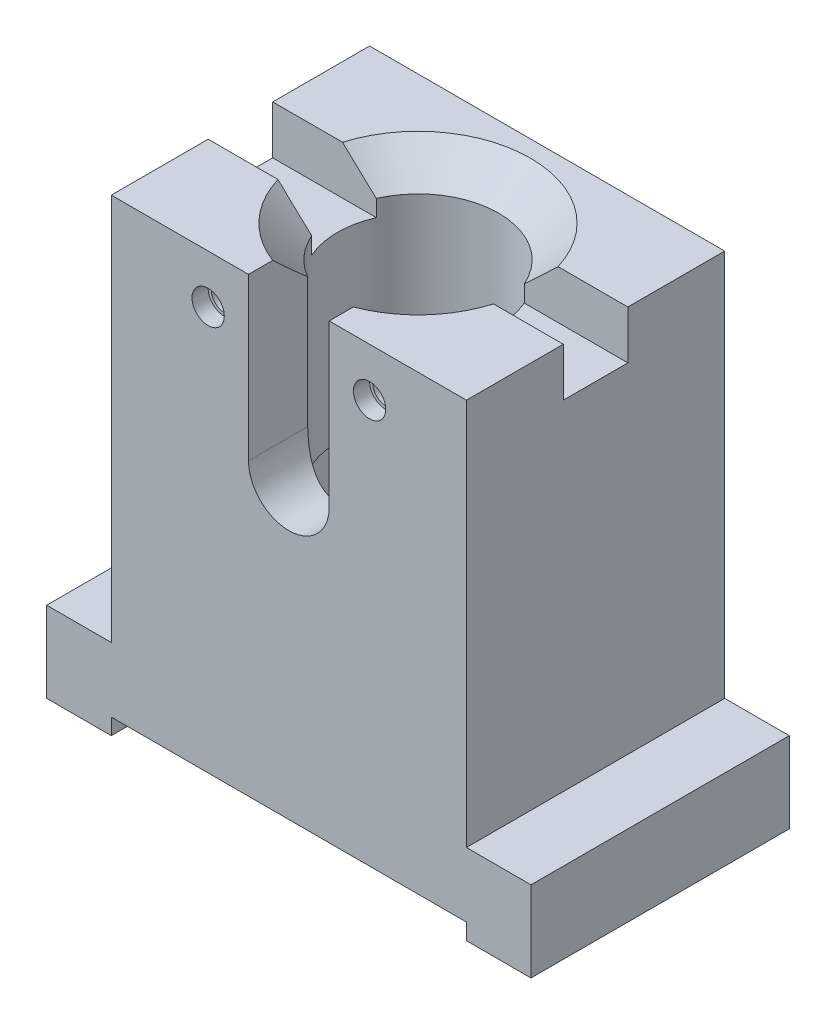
ISO-10303-21;
HEADER;
FILE_DESCRIPTION(('STEP AP214'),'2;1');
FILE_NAME('part.step','',(''),(''),'','','');
FILE_SCHEMA(('AUTOMOTIVE_DESIGN { 1 0 10303 214 1 1 1 1 }'));
ENDSEC;
DATA;
#1=APPLICATION_CONTEXT('core data for automotive mechanical design processes');
#2=APPLICATION_PROTOCOL_DEFINITION('international standard','automotive_design',2000,#1);
#3=PRODUCT_CONTEXT('',#1,'mechanical');
#4=PRODUCT('Part','Part','',(#3));
#5=PRODUCT_RELATED_PRODUCT_CATEGORY('part','',(#4));
#6=PRODUCT_DEFINITION_FORMATION('','',#4);
#7=PRODUCT_DEFINITION_CONTEXT('part definition',#1,'design');
#8=PRODUCT_DEFINITION('design','',#6,#7);
#9=PRODUCT_DEFINITION_SHAPE('','',#8);
#10=(LENGTH_UNIT() NAMED_UNIT(*) SI_UNIT(.MILLI.,.METRE.));
#11=(NAMED_UNIT(*) PLANE_ANGLE_UNIT() SI_UNIT($,.RADIAN.));
#12=(NAMED_UNIT(*) SI_UNIT($,.STERADIAN.) SOLID_ANGLE_UNIT());
#13=UNCERTAINTY_MEASURE_WITH_UNIT(LENGTH_MEASURE(1.E-05),#10,'distance_accuracy_value','');
#14=(GEOMETRIC_REPRESENTATION_CONTEXT(3) GLOBAL_UNCERTAINTY_ASSIGNED_CONTEXT((#13)) GLOBAL_UNIT_ASSIGNED_CONTEXT((#10,
#11,#12)) REPRESENTATION_CONTEXT('',''));
#15=CARTESIAN_POINT('',(0.,0.,0.));
#16=DIRECTION('',(0.,0.,1.));
#17=DIRECTION('',(1.,0.,0.));
#18=AXIS2_PLACEMENT_3D('',#15,#16,#17);
#19=CARTESIAN_POINT('',(-11.,28.,8.));
#20=DIRECTION('',(0.,-1.,0.));
#21=DIRECTION('',(0.,0.,-1.));
#22=AXIS2_PLACEMENT_3D('',#19,#20,#21);
#23=PLANE('',#22);
#24=CARTESIAN_POINT('',(0.,28.,0.));
#25=DIRECTION('',(0.,1.,0.));
#26=DIRECTION('',(0.,0.,1.));
#27=AXIS2_PLACEMENT_3D('',#24,#25,#26);
#28=CIRCLE('',#27,6.96794894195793);
#29=CARTESIAN_POINT('',(2.5,28.,6.50402279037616));
#30=VERTEX_POINT('',#29);
#31=CARTESIAN_POINT('',(6.67475186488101,28.,2.));
#32=VERTEX_POINT('',#31);
#33=EDGE_CURVE('E242',#30,#32,#28,.T.);
#34=ORIENTED_EDGE('',*,*,#33,.F.);
#35=DIRECTION('',(0.,0.,1.));
#36=VECTOR('',#35,1.);
#37=CARTESIAN_POINT('',(2.5,28.,-8.001));
#38=LINE('',#37,#36);
#39=CARTESIAN_POINT('',(2.5,28.,8.));
#40=VERTEX_POINT('',#39);
#41=EDGE_CURVE('E236',#30,#40,#38,.T.);
#42=ORIENTED_EDGE('',*,*,#41,.T.);
#43=DIRECTION('',(-1.,0.,0.));
#44=VECTOR('',#43,1.);
#45=CARTESIAN_POINT('',(-11.,28.,8.));
#46=LINE('',#45,#44);
#47=CARTESIAN_POINT('',(11.,28.,8.));
#48=VERTEX_POINT('',#47);
#49=EDGE_CURVE('E266',#48,#40,#46,.T.);
#50=ORIENTED_EDGE('',*,*,#49,.F.);
#51=DIRECTION('',(0.,0.,-1.));
#52=VECTOR('',#51,1.);
#53=CARTESIAN_POINT('',(11.,28.,8.));
#54=LINE('',#53,#52);
#55=CARTESIAN_POINT('',(11.,28.,2.));
#56=VERTEX_POINT('',#55);
#57=EDGE_CURVE('E348',#48,#56,#54,.T.);
#58=ORIENTED_EDGE('',*,*,#57,.T.);
#59=DIRECTION('',(-1.,0.,0.));
#60=VECTOR('',#59,1.);
#61=CARTESIAN_POINT('',(15.,28.,2.));
#62=LINE('',#61,#60);
#63=EDGE_CURVE('E501',#56,#32,#62,.T.);
#64=ORIENTED_EDGE('',*,*,#63,.T.);
#65=EDGE_LOOP('',(#34,#42,#50,#58,#64));
#66=FACE_BOUND('',#65,.T.);
#67=ADVANCED_FACE('F31',(#66),#23,.F.);
#68=CARTESIAN_POINT('',(0.,26.0320510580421,0.));
#69=DIRECTION('',(0.,1.,0.));
#70=DIRECTION('',(0.,0.,1.));
#71=AXIS2_PLACEMENT_3D('',#68,#69,#70);
#72=CONICAL_SURFACE('',#71,5.,0.785398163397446);
#73=CARTESIAN_POINT('',(2.5,23.8078764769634,-1.20631950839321));
#74=CARTESIAN_POINT('',(2.5,23.7699121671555,-1.11895603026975));
#75=CARTESIAN_POINT('',(2.5,23.7347076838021,-1.03026081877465));
#76=CARTESIAN_POINT('',(2.5,23.6712764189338,-0.850085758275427));
#77=CARTESIAN_POINT('',(2.5,23.6430740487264,-0.758597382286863));
#78=CARTESIAN_POINT('',(2.5,23.5958767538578,-0.575217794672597));
#79=CARTESIAN_POINT('',(2.5,23.5767048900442,-0.483373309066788));
#80=CARTESIAN_POINT('',(2.5,23.5481258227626,-0.298274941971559));
#81=CARTESIAN_POINT('',(2.5,23.5387049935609,-0.205023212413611));
#82=CARTESIAN_POINT('',(2.5,23.5306127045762,-0.023476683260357));
#83=CARTESIAN_POINT('',(2.5,23.531348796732,0.0647915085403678));
#84=CARTESIAN_POINT('',(2.5,23.542082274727,0.240784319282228));
#85=CARTESIAN_POINT('',(2.5,23.552083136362,0.328508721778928));
#86=CARTESIAN_POINT('',(2.5,23.5806308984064,0.502651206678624));
#87=CARTESIAN_POINT('',(2.5,23.5991894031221,0.589067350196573));
#88=CARTESIAN_POINT('',(2.5,23.6436987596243,0.759941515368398));
#89=CARTESIAN_POINT('',(2.5,23.6696504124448,0.844399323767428));
#90=CARTESIAN_POINT('',(2.5,23.7547850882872,1.08914080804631));
#91=CARTESIAN_POINT('',(2.5,23.822356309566,1.24651043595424));
#92=CARTESIAN_POINT('',(2.5,23.9349476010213,1.47691777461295));
#93=CARTESIAN_POINT('',(2.5,23.9743974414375,1.55285523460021));
#94=CARTESIAN_POINT('',(2.5,24.0563615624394,1.70306159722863));
#95=CARTESIAN_POINT('',(2.5,24.0988753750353,1.77733075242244));
#96=CARTESIAN_POINT('',(2.5,24.1872490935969,1.92585213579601));
#97=CARTESIAN_POINT('',(2.5,24.2331588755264,2.00007439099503));
#98=CARTESIAN_POINT('',(2.5,24.3270744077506,2.14718013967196));
#99=CARTESIAN_POINT('',(2.5,24.3750802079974,2.22006360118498));
#100=CARTESIAN_POINT('',(2.5,24.4727629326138,2.3646002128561));
#101=CARTESIAN_POINT('',(2.5,24.5224382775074,2.43625443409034));
#102=CARTESIAN_POINT('',(2.5,24.6232080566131,2.57855049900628));
#103=CARTESIAN_POINT('',(2.5,24.6743024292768,2.64919238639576));
#104=CARTESIAN_POINT('',(2.5,24.8546006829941,2.89412399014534));
#105=CARTESIAN_POINT('',(2.5,24.9868571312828,3.06616682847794));
#106=CARTESIAN_POINT('',(2.5,25.2561759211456,3.40646101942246));
#107=CARTESIAN_POINT('',(2.5,25.3932392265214,3.57471160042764));
#108=CARTESIAN_POINT('',(2.5,25.6707911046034,3.90851683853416));
#109=CARTESIAN_POINT('',(2.5,25.8112815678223,4.07406991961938));
#110=CARTESIAN_POINT('',(2.5,26.0946838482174,4.40309194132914));
#111=CARTESIAN_POINT('',(2.5,26.2375957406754,4.56656081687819));
#112=CARTESIAN_POINT('',(2.5,26.5255753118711,4.89230148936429));
#113=CARTESIAN_POINT('',(2.5,26.6706474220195,5.05456936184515));
#114=CARTESIAN_POINT('',(2.5,26.9621823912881,5.37785415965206));
#115=CARTESIAN_POINT('',(2.5,27.1086452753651,5.53887106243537));
#116=CARTESIAN_POINT('',(2.5,27.549537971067,6.02033138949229));
#117=CARTESIAN_POINT('',(2.5,27.8455760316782,6.33930132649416));
#118=CARTESIAN_POINT('',(2.5,28.3960434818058,6.92728534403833));
#119=CARTESIAN_POINT('',(2.5,28.6500940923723,7.19665546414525));
#120=CARTESIAN_POINT('',(2.5,29.159671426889,7.73404833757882));
#121=CARTESIAN_POINT('',(2.5,29.4151983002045,8.00207094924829));
#122=CARTESIAN_POINT('',(2.5,29.9262122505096,8.53592732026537));
#123=CARTESIAN_POINT('',(2.5,30.1816946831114,8.80176553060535));
#124=CARTESIAN_POINT('',(2.5,30.6934587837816,9.33261212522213));
#125=CARTESIAN_POINT('',(2.5,30.9497403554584,9.59762060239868));
#126=CARTESIAN_POINT('',(2.5,31.2063195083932,9.86233940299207));
#127=B_SPLINE_CURVE_WITH_KNOTS('',3,(#73,#74,#75,#76,#77,#78,#79,#80,#81,#82,#83,#84,#85,#86,
#87,#88,#89,#90,#91,#92,#93,#94,#95,#96,#97,#98,#99,#100,#101,#102,#103,#104,#105,#106,#107,
#108,#109,#110,#111,#112,#113,#114,#115,#116,#117,#118,#119,#120,#121,#122,#123,#124,#125,#126),
.UNSPECIFIED.,.F.,.F.,(4,2,2,2,2,2,2,2,2,2,2,2,2,2,2,2,2,2,2,2,2,2,2,2,2,2,4),(0.,
0.285903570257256,0.572790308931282,0.853794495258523,1.13440548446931,1.39872138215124,
1.66313648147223,1.92791119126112,2.19271459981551,2.70503211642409,2.96172656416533,
3.21838188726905,3.48016402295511,3.74195240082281,4.00349972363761,4.26503571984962,
4.91589312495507,5.56688178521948,6.21823805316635,6.86961460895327,7.52259042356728,
8.17557797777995,9.48108333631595,10.5918968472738,11.7028247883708,12.8089292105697,
13.9149050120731),.UNSPECIFIED.);
#128=CARTESIAN_POINT('',(2.5,26.0320510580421,4.3301270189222));
#129=VERTEX_POINT('',#128);
#130=EDGE_CURVE('E572',#129,#30,#127,.T.);
#131=ORIENTED_EDGE('',*,*,#130,.T.);
#132=ORIENTED_EDGE('',*,*,#33,.T.);
#133=CARTESIAN_POINT('',(-15.2823324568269,36.4446979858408,2.));
#134=CARTESIAN_POINT('',(-14.8220980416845,35.9883741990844,2.));
#135=CARTESIAN_POINT('',(-14.3617081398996,35.5322068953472,2.));
#136=CARTESIAN_POINT('',(-13.4403161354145,34.6201944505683,2.));
#137=CARTESIAN_POINT('',(-12.979313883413,34.1643494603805,2.));
#138=CARTESIAN_POINT('',(-12.0537895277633,33.2504186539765,2.));
#139=CARTESIAN_POINT('',(-11.5892635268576,32.7923367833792,2.));
#140=CARTESIAN_POINT('',(-10.6594754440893,31.8772156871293,2.));
#141=CARTESIAN_POINT('',(-10.1942136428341,31.42017617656,2.));
#142=CARTESIAN_POINT('',(-9.42208455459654,30.6638682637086,2.));
#143=CARTESIAN_POINT('',(-9.11558962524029,30.3642198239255,2.));
#144=CARTESIAN_POINT('',(-8.50183022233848,29.7656920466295,2.));
#145=CARTESIAN_POINT('',(-8.19456572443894,29.4668127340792,2.));
#146=CARTESIAN_POINT('',(-7.57866333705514,28.8698047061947,2.));
#147=CARTESIAN_POINT('',(-7.27002432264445,28.5716771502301,2.));
#148=CARTESIAN_POINT('',(-6.65129347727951,27.9770060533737,2.));
#149=CARTESIAN_POINT('',(-6.34120182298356,27.6804623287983,2.));
#150=CARTESIAN_POINT('',(-5.72030867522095,27.0911193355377,2.));
#151=CARTESIAN_POINT('',(-5.40951781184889,26.7983089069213,2.));
#152=CARTESIAN_POINT('',(-4.94063386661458,26.3618406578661,2.));
#153=CARTESIAN_POINT('',(-4.78385218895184,26.2167751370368,2.));
#154=CARTESIAN_POINT('',(-4.46914369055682,25.9278990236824,2.));
#155=CARTESIAN_POINT('',(-4.31121690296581,25.784088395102,2.));
#156=CARTESIAN_POINT('',(-3.99415725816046,25.4984322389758,2.));
#157=CARTESIAN_POINT('',(-3.83502740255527,25.3565833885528,2.));
#158=CARTESIAN_POINT('',(-3.51471153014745,25.0752342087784,2.));
#159=CARTESIAN_POINT('',(-3.35352559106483,24.9357337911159,2.));
#160=CARTESIAN_POINT('',(-3.02838103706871,24.6602161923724,2.));
#161=CARTESIAN_POINT('',(-2.86442453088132,24.5241965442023,2.));
#162=CARTESIAN_POINT('',(-2.61534986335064,24.3241088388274,2.));
#163=CARTESIAN_POINT('',(-2.53181077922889,24.2580767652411,2.));
#164=CARTESIAN_POINT('',(-2.36343611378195,24.1276898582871,2.));
#165=CARTESIAN_POINT('',(-2.2786006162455,24.0633349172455,2.));
#166=CARTESIAN_POINT('',(-2.14159728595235,23.9621101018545,2.));
#167=CARTESIAN_POINT('',(-2.08994174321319,23.9245468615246,2.));
#168=CARTESIAN_POINT('',(-1.98596841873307,23.8503383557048,2.));
#169=CARTESIAN_POINT('',(-1.93365058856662,23.8136931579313,2.));
#170=CARTESIAN_POINT('',(-1.82823951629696,23.7414759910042,2.));
#171=CARTESIAN_POINT('',(-1.77514591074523,23.7059045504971,2.));
#172=CARTESIAN_POINT('',(-1.66810450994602,23.6360734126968,2.));
#173=CARTESIAN_POINT('',(-1.61415672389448,23.6018137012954,2.));
#174=CARTESIAN_POINT('',(-1.45186235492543,23.5019965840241,2.));
#175=CARTESIAN_POINT('',(-1.34208963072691,23.4387215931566,2.));
#176=CARTESIAN_POINT('',(-1.11778699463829,23.321229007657,2.));
#177=CARTESIAN_POINT('',(-1.00326202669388,23.2670022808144,2.));
#178=CARTESIAN_POINT('',(-0.825750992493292,23.1951152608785,2.));
#179=CARTESIAN_POINT('',(-0.764778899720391,23.1724949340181,2.));
#180=CARTESIAN_POINT('',(-0.641390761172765,23.1315733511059,2.));
#181=CARTESIAN_POINT('',(-0.578974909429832,23.1132715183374,2.));
#182=CARTESIAN_POINT('',(-0.453114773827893,23.0818364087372,2.));
#183=CARTESIAN_POINT('',(-0.389675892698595,23.0686818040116,2.));
#184=CARTESIAN_POINT('',(-0.261875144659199,23.0481377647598,2.));
#185=CARTESIAN_POINT('',(-0.197513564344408,23.0407465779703,2.));
#186=CARTESIAN_POINT('',(-0.06775862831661,23.0321420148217,2.));
#187=CARTESIAN_POINT('',(-0.0023612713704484,23.030987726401,2.));
#188=CARTESIAN_POINT('',(0.128227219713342,23.0350941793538,2.));
#189=CARTESIAN_POINT('',(0.193418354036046,23.0403549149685,2.));
#190=CARTESIAN_POINT('',(0.32320148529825,23.0569712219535,2.));
#191=CARTESIAN_POINT('',(0.387791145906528,23.0683447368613,2.));
#192=CARTESIAN_POINT('',(0.515762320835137,23.0965388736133,2.));
#193=CARTESIAN_POINT('',(0.579143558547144,23.1133607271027,2.));
#194=CARTESIAN_POINT('',(0.736731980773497,23.1615111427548,2.));
#195=CARTESIAN_POINT('',(0.830016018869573,23.1958500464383,2.));
#196=CARTESIAN_POINT('',(1.01322567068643,23.2725158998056,2.));
#197=CARTESIAN_POINT('',(1.10314861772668,23.3148490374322,2.));
#198=CARTESIAN_POINT('',(1.28040188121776,23.4055727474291,2.));
#199=CARTESIAN_POINT('',(1.36771748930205,23.4539917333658,2.));
#200=CARTESIAN_POINT('',(1.49673639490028,23.5298534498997,2.));
#201=CARTESIAN_POINT('',(1.53940996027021,23.555674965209,2.));
#202=CARTESIAN_POINT('',(1.62417334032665,23.6082564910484,2.));
#203=CARTESIAN_POINT('',(1.66626317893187,23.635016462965,2.));
#204=CARTESIAN_POINT('',(1.8072358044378,23.7265637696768,2.));
#205=CARTESIAN_POINT('',(1.90491029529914,23.7932130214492,2.));
#206=CARTESIAN_POINT('',(2.09796038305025,23.9297735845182,2.));
#207=CARTESIAN_POINT('',(2.19333544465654,23.9996856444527,2.));
#208=CARTESIAN_POINT('',(2.38232942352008,24.1419742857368,2.));
#209=CARTESIAN_POINT('',(2.47594704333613,24.2143525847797,2.));
#210=CARTESIAN_POINT('',(2.66173192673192,24.3609510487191,2.));
#211=CARTESIAN_POINT('',(2.75389910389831,24.4351713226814,2.));
#212=CARTESIAN_POINT('',(3.0291118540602,24.6603125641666,2.));
#213=CARTESIAN_POINT('',(3.21041247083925,24.8133636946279,2.));
#214=CARTESIAN_POINT('',(3.56984507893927,25.122961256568,2.));
#215=CARTESIAN_POINT('',(3.74797836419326,25.279506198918,2.));
#216=CARTESIAN_POINT('',(4.10271798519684,25.5955795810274,2.));
#217=CARTESIAN_POINT('',(4.279316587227,25.7551166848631,2.));
#218=CARTESIAN_POINT('',(4.63096248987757,26.0759231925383,2.));
#219=CARTESIAN_POINT('',(4.80600962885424,26.2371927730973,2.));
#220=CARTESIAN_POINT('',(5.15466768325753,26.5607386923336,2.));
#221=CARTESIAN_POINT('',(5.32828039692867,26.72301309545,2.));
#222=CARTESIAN_POINT('',(5.67460859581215,27.0485040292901,2.));
#223=CARTESIAN_POINT('',(5.84732411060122,27.2117205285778,2.));
#224=CARTESIAN_POINT('',(6.41503299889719,27.7504540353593,2.));
#225=CARTESIAN_POINT('',(6.8085715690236,28.1275033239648,2.));
#226=CARTESIAN_POINT('',(7.59350629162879,28.8838342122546,2.));
#227=CARTESIAN_POINT('',(7.98490240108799,29.2631158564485,2.));
#228=CARTESIAN_POINT('',(8.76654133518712,30.0233806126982,2.));
#229=CARTESIAN_POINT('',(9.15678322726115,30.4043646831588,2.));
#230=CARTESIAN_POINT('',(9.93629652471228,31.1673178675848,2.));
#231=CARTESIAN_POINT('',(10.3255679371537,31.5492869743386,2.));
#232=CARTESIAN_POINT('',(11.0962342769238,32.3068689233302,2.));
#233=CARTESIAN_POINT('',(11.4776418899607,32.6824688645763,2.));
#234=CARTESIAN_POINT('',(12.2399610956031,33.434173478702,2.));
#235=CARTESIAN_POINT('',(12.6208726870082,33.8102781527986,2.));
#236=CARTESIAN_POINT('',(13.382044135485,34.5625997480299,2.));
#237=CARTESIAN_POINT('',(13.7623042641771,34.9388163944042,2.));
#238=CARTESIAN_POINT('',(14.5225239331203,35.6915508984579,2.));
#239=CARTESIAN_POINT('',(14.9024834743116,36.0680687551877,2.));
#240=CARTESIAN_POINT('',(15.2823324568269,36.4446979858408,2.));
#241=B_SPLINE_CURVE_WITH_KNOTS('',3,(#133,#134,#135,#136,#137,#138,#139,#140,#141,#142,#143,
#144,#145,#146,#147,#148,#149,#150,#151,#152,#153,#154,#155,#156,#157,#158,#159,#160,#161,#162,
#163,#164,#165,#166,#167,#168,#169,#170,#171,#172,#173,#174,#175,#176,#177,#178,#179,#180,#181,
#182,#183,#184,#185,#186,#187,#188,#189,#190,#191,#192,#193,#194,#195,#196,#197,#198,#199,#200,
#201,#202,#203,#204,#205,#206,#207,#208,#209,#210,#211,#212,#213,#214,#215,#216,#217,#218,#219,
#220,#221,#222,#223,#224,#225,#226,#227,#228,#229,#230,#231,#232,#233,#234,#235,#236,#237,#238,
#239,#240),.UNSPECIFIED.,.F.,.F.,(4,2,2,2,2,2,2,2,2,2,2,2,2,2,2,2,2,2,2,2,2,2,2,2,2,2,2,2,2,2,2,
2,2,2,2,2,2,2,2,2,2,2,2,2,2,2,2,2,2,2,2,2,2,4),(0.,1.94433158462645,3.88928867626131,
5.84648250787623,7.80305478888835,9.08896006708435,10.3749065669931,11.6622419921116,
12.9494247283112,14.2304016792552,14.8711935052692,15.511966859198,16.1514734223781,
16.7909558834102,17.4299717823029,17.7494112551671,18.0688301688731,18.2604300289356,
18.452043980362,18.6437507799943,18.8354555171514,19.2153039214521,19.594766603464,
19.7897371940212,19.9846817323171,20.1788097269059,20.3728786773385,20.5687830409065,
20.7646872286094,20.9611696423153,21.1576965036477,21.4553674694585,21.7532697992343,
22.0526185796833,22.2022428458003,22.3518609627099,22.7064973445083,23.0612155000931,
23.4161859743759,23.7711775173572,24.4828851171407,25.1942949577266,25.9082476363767,
26.622273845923,27.335199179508,28.048100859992,29.6831205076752,31.3181728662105,
32.9543052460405,34.5904256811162,36.1963278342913,37.8022338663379,39.4069861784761,
41.0117334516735),.UNSPECIFIED.);
#242=CARTESIAN_POINT('',(4.58257569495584,26.0320510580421,2.));
#243=VERTEX_POINT('',#242);
#244=EDGE_CURVE('E351',#243,#32,#241,.T.);
#245=ORIENTED_EDGE('',*,*,#244,.F.);
#246=CARTESIAN_POINT('',(0.,26.0320510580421,0.));
#247=DIRECTION('',(0.,1.,0.));
#248=DIRECTION('',(0.,0.,1.));
#249=AXIS2_PLACEMENT_3D('',#246,#247,#248);
#250=CIRCLE('',#249,5.);
#251=EDGE_CURVE('E54',#129,#243,#250,.T.);
#252=ORIENTED_EDGE('',*,*,#251,.F.);
#253=EDGE_LOOP('',(#131,#132,#245,#252));
#254=FACE_BOUND('',#253,.T.);
#255=ADVANCED_FACE('F390',(#254),#72,.F.);
#256=DIRECTION('',(0.,0.,-1.));
#257=VECTOR('',#256,1.);
#258=CARTESIAN_POINT('',(-11.,28.,8.));
#259=LINE('',#258,#257);
#260=CARTESIAN_POINT('',(-11.,28.,-2.));
#261=VERTEX_POINT('',#260);
#262=CARTESIAN_POINT('',(-11.,28.,-8.));
#263=VERTEX_POINT('',#262);
#264=EDGE_CURVE('E343',#261,#263,#259,.T.);
#265=ORIENTED_EDGE('',*,*,#264,.F.);
#266=DIRECTION('',(-1.,0.,0.));
#267=VECTOR('',#266,1.);
#268=CARTESIAN_POINT('',(15.,28.,-2.));
#269=LINE('',#268,#267);
#270=CARTESIAN_POINT('',(-6.67475186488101,28.,-2.));
#271=VERTEX_POINT('',#270);
#272=EDGE_CURVE('E498',#271,#261,#269,.T.);
#273=ORIENTED_EDGE('',*,*,#272,.F.);
#274=CARTESIAN_POINT('',(6.67475186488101,28.,-2.));
#275=VERTEX_POINT('',#274);
#276=EDGE_CURVE('E241',#275,#271,#28,.T.);
#277=ORIENTED_EDGE('',*,*,#276,.F.);
#278=CARTESIAN_POINT('',(11.,28.,-2.));
#279=VERTEX_POINT('',#278);
#280=EDGE_CURVE('E500',#279,#275,#269,.T.);
#281=ORIENTED_EDGE('',*,*,#280,.F.);
#282=CARTESIAN_POINT('',(11.,28.,-8.));
#283=VERTEX_POINT('',#282);
#284=EDGE_CURVE('E347',#279,#283,#54,.T.);
#285=ORIENTED_EDGE('',*,*,#284,.T.);
#286=DIRECTION('',(-1.,0.,0.));
#287=VECTOR('',#286,1.);
#288=CARTESIAN_POINT('',(-11.,28.,-8.));
#289=LINE('',#288,#287);
#290=EDGE_CURVE('E292',#283,#263,#289,.T.);
#291=ORIENTED_EDGE('',*,*,#290,.T.);
#292=EDGE_LOOP('',(#265,#273,#277,#281,#285,#291));
#293=FACE_BOUND('',#292,.T.);
#294=ADVANCED_FACE('F392',(#293),#23,.F.);
#295=CARTESIAN_POINT('',(15.2823324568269,36.4446979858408,-2.));
#296=CARTESIAN_POINT('',(14.8220980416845,35.9883741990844,-2.));
#297=CARTESIAN_POINT('',(14.3617081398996,35.5322068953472,-2.));
#298=CARTESIAN_POINT('',(13.4403161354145,34.6201944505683,-2.));
#299=CARTESIAN_POINT('',(12.979313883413,34.1643494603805,-2.));
#300=CARTESIAN_POINT('',(12.0537895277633,33.2504186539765,-2.));
#301=CARTESIAN_POINT('',(11.5892635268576,32.7923367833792,-2.));
#302=CARTESIAN_POINT('',(10.6594754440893,31.8772156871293,-2.));
#303=CARTESIAN_POINT('',(10.1942136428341,31.42017617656,-2.));
#304=CARTESIAN_POINT('',(9.42208455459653,30.6638682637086,-2.));
#305=CARTESIAN_POINT('',(9.11558962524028,30.3642198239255,-2.));
#306=CARTESIAN_POINT('',(8.50183022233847,29.7656920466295,-2.));
#307=CARTESIAN_POINT('',(8.19456572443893,29.4668127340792,-2.));
#308=CARTESIAN_POINT('',(7.57866333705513,28.8698047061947,-2.));
#309=CARTESIAN_POINT('',(7.27002432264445,28.5716771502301,-2.));
#310=CARTESIAN_POINT('',(6.6512934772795,27.9770060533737,-2.));
#311=CARTESIAN_POINT('',(6.34120182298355,27.6804623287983,-2.));
#312=CARTESIAN_POINT('',(5.72030867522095,27.0911193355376,-2.));
#313=CARTESIAN_POINT('',(5.40951781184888,26.7983089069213,-2.));
#314=CARTESIAN_POINT('',(4.94063386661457,26.3618406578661,-2.));
#315=CARTESIAN_POINT('',(4.78385218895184,26.2167751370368,-2.));
#316=CARTESIAN_POINT('',(4.46914369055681,25.9278990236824,-2.));
#317=CARTESIAN_POINT('',(4.31121690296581,25.784088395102,-2.));
#318=CARTESIAN_POINT('',(3.99415725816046,25.4984322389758,-2.));
#319=CARTESIAN_POINT('',(3.83502740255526,25.3565833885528,-2.));
#320=CARTESIAN_POINT('',(3.51471153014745,25.0752342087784,-2.));
#321=CARTESIAN_POINT('',(3.35352559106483,24.9357337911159,-2.));
#322=CARTESIAN_POINT('',(3.02838103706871,24.6602161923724,-2.));
#323=CARTESIAN_POINT('',(2.86442453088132,24.5241965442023,-2.));
#324=CARTESIAN_POINT('',(2.61534986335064,24.3241088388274,-2.));
#325=CARTESIAN_POINT('',(2.53181077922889,24.2580767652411,-2.));
#326=CARTESIAN_POINT('',(2.36343611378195,24.1276898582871,-2.));
#327=CARTESIAN_POINT('',(2.2786006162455,24.0633349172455,-2.));
#328=CARTESIAN_POINT('',(2.14159728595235,23.9621101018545,-2.));
#329=CARTESIAN_POINT('',(2.08994174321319,23.9245468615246,-2.));
#330=CARTESIAN_POINT('',(1.98596841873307,23.8503383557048,-2.));
#331=CARTESIAN_POINT('',(1.93365058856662,23.8136931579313,-2.));
#332=CARTESIAN_POINT('',(1.82823951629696,23.7414759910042,-2.));
#333=CARTESIAN_POINT('',(1.77514591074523,23.7059045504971,-2.));
#334=CARTESIAN_POINT('',(1.66810450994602,23.6360734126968,-2.));
#335=CARTESIAN_POINT('',(1.61415672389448,23.6018137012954,-2.));
#336=CARTESIAN_POINT('',(1.45186235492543,23.5019965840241,-2.));
#337=CARTESIAN_POINT('',(1.34208963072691,23.4387215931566,-2.));
#338=CARTESIAN_POINT('',(1.11778699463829,23.321229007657,-2.));
#339=CARTESIAN_POINT('',(1.00326202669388,23.2670022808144,-2.));
#340=CARTESIAN_POINT('',(0.825750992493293,23.1951152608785,-2.));
#341=CARTESIAN_POINT('',(0.764778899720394,23.1724949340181,-2.));
#342=CARTESIAN_POINT('',(0.641390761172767,23.1315733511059,-2.));
#343=CARTESIAN_POINT('',(0.578974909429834,23.1132715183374,-2.));
#344=CARTESIAN_POINT('',(0.453114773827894,23.0818364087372,-2.));
#345=CARTESIAN_POINT('',(0.389675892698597,23.0686818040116,-2.));
#346=CARTESIAN_POINT('',(0.2618751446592,23.0481377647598,-2.));
#347=CARTESIAN_POINT('',(0.197513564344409,23.0407465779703,-2.));
#348=CARTESIAN_POINT('',(0.0677586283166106,23.0321420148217,-2.));
#349=CARTESIAN_POINT('',(0.00236127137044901,23.030987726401,-2.));
#350=CARTESIAN_POINT('',(-0.128227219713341,23.0350941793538,-2.));
#351=CARTESIAN_POINT('',(-0.193418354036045,23.0403549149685,-2.));
#352=CARTESIAN_POINT('',(-0.323201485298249,23.0569712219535,-2.));
#353=CARTESIAN_POINT('',(-0.387791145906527,23.0683447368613,-2.));
#354=CARTESIAN_POINT('',(-0.515762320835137,23.0965388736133,-2.));
#355=CARTESIAN_POINT('',(-0.579143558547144,23.1133607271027,-2.));
#356=CARTESIAN_POINT('',(-0.736731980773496,23.1615111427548,-2.));
#357=CARTESIAN_POINT('',(-0.830016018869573,23.1958500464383,-2.));
#358=CARTESIAN_POINT('',(-1.01322567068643,23.2725158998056,-2.));
#359=CARTESIAN_POINT('',(-1.10314861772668,23.3148490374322,-2.));
#360=CARTESIAN_POINT('',(-1.28040188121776,23.4055727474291,-2.));
#361=CARTESIAN_POINT('',(-1.36771748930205,23.4539917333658,-2.));
#362=CARTESIAN_POINT('',(-1.49673639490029,23.5298534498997,-2.));
#363=CARTESIAN_POINT('',(-1.53940996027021,23.555674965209,-2.));
#364=CARTESIAN_POINT('',(-1.62417334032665,23.6082564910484,-2.));
#365=CARTESIAN_POINT('',(-1.66626317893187,23.635016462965,-2.));
#366=CARTESIAN_POINT('',(-1.80723580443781,23.7265637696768,-2.));
#367=CARTESIAN_POINT('',(-1.90491029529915,23.7932130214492,-2.));
#368=CARTESIAN_POINT('',(-2.09796038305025,23.9297735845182,-2.));
#369=CARTESIAN_POINT('',(-2.19333544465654,23.9996856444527,-2.));
#370=CARTESIAN_POINT('',(-2.38232942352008,24.1419742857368,-2.));
#371=CARTESIAN_POINT('',(-2.47594704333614,24.2143525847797,-2.));
#372=CARTESIAN_POINT('',(-2.66173192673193,24.3609510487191,-2.));
#373=CARTESIAN_POINT('',(-2.75389910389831,24.4351713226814,-2.));
#374=CARTESIAN_POINT('',(-3.0291118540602,24.6603125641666,-2.));
#375=CARTESIAN_POINT('',(-3.21041247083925,24.8133636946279,-2.));
#376=CARTESIAN_POINT('',(-3.56984507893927,25.122961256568,-2.));
#377=CARTESIAN_POINT('',(-3.74797836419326,25.279506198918,-2.));
#378=CARTESIAN_POINT('',(-4.10271798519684,25.5955795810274,-2.));
#379=CARTESIAN_POINT('',(-4.279316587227,25.7551166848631,-2.));
#380=CARTESIAN_POINT('',(-4.63096248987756,26.0759231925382,-2.));
#381=CARTESIAN_POINT('',(-4.80600962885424,26.2371927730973,-2.));
#382=CARTESIAN_POINT('',(-5.15466768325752,26.5607386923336,-2.));
#383=CARTESIAN_POINT('',(-5.32828039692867,26.72301309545,-2.));
#384=CARTESIAN_POINT('',(-5.67460859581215,27.0485040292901,-2.));
#385=CARTESIAN_POINT('',(-5.84732411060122,27.2117205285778,-2.));
#386=CARTESIAN_POINT('',(-6.41503299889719,27.7504540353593,-2.));
#387=CARTESIAN_POINT('',(-6.8085715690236,28.1275033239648,-2.));
#388=CARTESIAN_POINT('',(-7.59350629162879,28.8838342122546,-2.));
#389=CARTESIAN_POINT('',(-7.98490240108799,29.2631158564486,-2.));
#390=CARTESIAN_POINT('',(-8.76654133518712,30.0233806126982,-2.));
#391=CARTESIAN_POINT('',(-9.15678322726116,30.4043646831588,-2.));
#392=CARTESIAN_POINT('',(-9.93629652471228,31.1673178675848,-2.));
#393=CARTESIAN_POINT('',(-10.3255679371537,31.5492869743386,-2.));
#394=CARTESIAN_POINT('',(-11.0962342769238,32.3068689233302,-2.));
#395=CARTESIAN_POINT('',(-11.4776418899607,32.6824688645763,-2.));
#396=CARTESIAN_POINT('',(-12.239961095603,33.434173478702,-2.));
#397=CARTESIAN_POINT('',(-12.6208726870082,33.8102781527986,-2.));
#398=CARTESIAN_POINT('',(-13.382044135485,34.5625997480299,-2.));
#399=CARTESIAN_POINT('',(-13.7623042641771,34.9388163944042,-2.));
#400=CARTESIAN_POINT('',(-14.5225239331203,35.6915508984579,-2.));
#401=CARTESIAN_POINT('',(-14.9024834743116,36.0680687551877,-2.));
#402=CARTESIAN_POINT('',(-15.2823324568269,36.4446979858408,-2.));
#403=B_SPLINE_CURVE_WITH_KNOTS('',3,(#295,#296,#297,#298,#299,#300,#301,#302,#303,#304,#305,
#306,#307,#308,#309,#310,#311,#312,#313,#314,#315,#316,#317,#318,#319,#320,#321,#322,#323,#324,
#325,#326,#327,#328,#329,#330,#331,#332,#333,#334,#335,#336,#337,#338,#339,#340,#341,#342,#343,
#344,#345,#346,#347,#348,#349,#350,#351,#352,#353,#354,#355,#356,#357,#358,#359,#360,#361,#362,
#363,#364,#365,#366,#367,#368,#369,#370,#371,#372,#373,#374,#375,#376,#377,#378,#379,#380,#381,
#382,#383,#384,#385,#386,#387,#388,#389,#390,#391,#392,#393,#394,#395,#396,#397,#398,#399,#400,
#401,#402),.UNSPECIFIED.,.F.,.F.,(4,2,2,2,2,2,2,2,2,2,2,2,2,2,2,2,2,2,2,2,2,2,2,2,2,2,2,2,2,2,2,
2,2,2,2,2,2,2,2,2,2,2,2,2,2,2,2,2,2,2,2,2,2,4),(0.,1.94433158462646,3.88928867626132,
5.84648250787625,7.80305478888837,9.08896006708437,10.3749065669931,11.6622419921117,
12.9494247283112,14.2304016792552,14.8711935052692,15.511966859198,16.1514734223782,
16.7909558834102,17.4299717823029,17.7494112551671,18.0688301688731,18.2604300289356,
18.452043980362,18.6437507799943,18.8354555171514,19.2153039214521,19.594766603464,
19.7897371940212,19.9846817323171,20.1788097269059,20.3728786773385,20.5687830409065,
20.7646872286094,20.9611696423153,21.1576965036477,21.4553674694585,21.7532697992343,
22.0526185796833,22.2022428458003,22.3518609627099,22.7064973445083,23.0612155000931,
23.4161859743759,23.7711775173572,24.4828851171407,25.1942949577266,25.9082476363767,
26.622273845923,27.335199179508,28.048100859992,29.6831205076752,31.3181728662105,
32.9543052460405,34.5904256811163,36.1963278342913,37.8022338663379,39.4069861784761,
41.0117334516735),.UNSPECIFIED.);
#404=CARTESIAN_POINT('',(4.58257569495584,26.0320510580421,-2.));
#405=VERTEX_POINT('',#404);
#406=EDGE_CURVE('E532',#275,#405,#403,.T.);
#407=ORIENTED_EDGE('',*,*,#406,.F.);
#408=ORIENTED_EDGE('',*,*,#276,.T.);
#409=CARTESIAN_POINT('',(-4.5825756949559,26.0320510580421,-2.));
#410=VERTEX_POINT('',#409);
#411=EDGE_CURVE('E358',#410,#271,#403,.T.);
#412=ORIENTED_EDGE('',*,*,#411,.F.);
#413=EDGE_CURVE('E251',#405,#410,#250,.T.);
#414=ORIENTED_EDGE('',*,*,#413,.F.);
#415=EDGE_LOOP('',(#407,#408,#412,#414));
#416=FACE_BOUND('',#415,.T.);
#417=ADVANCED_FACE('F397',(#416),#72,.F.);
#418=CARTESIAN_POINT('',(-2.5,28.,8.));
#419=VERTEX_POINT('',#418);
#420=CARTESIAN_POINT('',(-11.,28.,8.));
#421=VERTEX_POINT('',#420);
#422=EDGE_CURVE('E234',#419,#421,#46,.T.);
#423=ORIENTED_EDGE('',*,*,#422,.F.);
#424=DIRECTION('',(0.,0.,1.));
#425=VECTOR('',#424,1.);
#426=CARTESIAN_POINT('',(-2.5,28.,-8.001));
#427=LINE('',#426,#425);
#428=CARTESIAN_POINT('',(-2.5,28.,6.50402279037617));
#429=VERTEX_POINT('',#428);
#430=EDGE_CURVE('E219',#429,#419,#427,.T.);
#431=ORIENTED_EDGE('',*,*,#430,.F.);
#432=CARTESIAN_POINT('',(-6.67475186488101,28.,2.));
#433=VERTEX_POINT('',#432);
#434=EDGE_CURVE('E232',#433,#429,#28,.T.);
#435=ORIENTED_EDGE('',*,*,#434,.F.);
#436=CARTESIAN_POINT('',(-11.,28.,2.));
#437=VERTEX_POINT('',#436);
#438=EDGE_CURVE('E502',#433,#437,#62,.T.);
#439=ORIENTED_EDGE('',*,*,#438,.T.);
#440=EDGE_CURVE('E344',#421,#437,#259,.T.);
#441=ORIENTED_EDGE('',*,*,#440,.F.);
#442=EDGE_LOOP('',(#423,#431,#435,#439,#441));
#443=FACE_BOUND('',#442,.T.);
#444=ADVANCED_FACE('F230',(#443),#23,.F.);
#445=CARTESIAN_POINT('',(11.,4.,8.));
#446=DIRECTION('',(-1.,0.,0.));
#447=DIRECTION('',(0.,0.,1.));
#448=AXIS2_PLACEMENT_3D('',#445,#446,#447);
#449=PLANE('',#448);
#450=ORIENTED_EDGE('',*,*,#284,.F.);
#451=DIRECTION('',(0.,-1.,0.));
#452=VECTOR('',#451,1.);
#453=CARTESIAN_POINT('',(11.,4.,-2.00000000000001));
#454=LINE('',#453,#452);
#455=CARTESIAN_POINT('',(11.,25.,-2.));
#456=VERTEX_POINT('',#455);
#457=EDGE_CURVE('E519',#279,#456,#454,.T.);
#458=ORIENTED_EDGE('',*,*,#457,.T.);
#459=DIRECTION('',(0.,0.,1.));
#460=VECTOR('',#459,1.);
#461=CARTESIAN_POINT('',(11.,25.,8.));
#462=LINE('',#461,#460);
#463=CARTESIAN_POINT('',(11.,25.,2.));
#464=VERTEX_POINT('',#463);
#465=EDGE_CURVE('E245',#456,#464,#462,.T.);
#466=ORIENTED_EDGE('',*,*,#465,.T.);
#467=DIRECTION('',(0.,1.,0.));
#468=VECTOR('',#467,1.);
#469=CARTESIAN_POINT('',(11.,4.,2.00000000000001));
#470=LINE('',#469,#468);
#471=EDGE_CURVE('E513',#464,#56,#470,.T.);
#472=ORIENTED_EDGE('',*,*,#471,.T.);
#473=ORIENTED_EDGE('',*,*,#57,.F.);
#474=DIRECTION('',(0.,1.,0.));
#475=VECTOR('',#474,1.);
#476=CARTESIAN_POINT('',(11.,4.,8.));
#477=LINE('',#476,#475);
#478=CARTESIAN_POINT('',(11.,4.,8.));
#479=VERTEX_POINT('',#478);
#480=EDGE_CURVE('E262',#479,#48,#477,.T.);
#481=ORIENTED_EDGE('',*,*,#480,.F.);
#482=DIRECTION('',(0.,0.,-1.));
#483=VECTOR('',#482,1.);
#484=CARTESIAN_POINT('',(11.,4.,8.));
#485=LINE('',#484,#483);
#486=CARTESIAN_POINT('',(11.,4.,-8.));
#487=VERTEX_POINT('',#486);
#488=EDGE_CURVE('E289',#479,#487,#485,.T.);
#489=ORIENTED_EDGE('',*,*,#488,.T.);
#490=DIRECTION('',(0.,1.,0.));
#491=VECTOR('',#490,1.);
#492=CARTESIAN_POINT('',(11.,4.,-8.));
#493=LINE('',#492,#491);
#494=EDGE_CURVE('E261',#487,#283,#493,.T.);
#495=ORIENTED_EDGE('',*,*,#494,.T.);
#496=EDGE_LOOP('',(#450,#458,#466,#472,#473,#481,#489,#495));
#497=FACE_BOUND('',#496,.T.);
#498=ADVANCED_FACE('F33',(#497),#449,.F.);
#499=CARTESIAN_POINT('',(-11.,4.,8.));
#500=DIRECTION('',(1.,0.,0.));
#501=DIRECTION('',(0.,0.,-1.));
#502=AXIS2_PLACEMENT_3D('',#499,#500,#501);
#503=PLANE('',#502);
#504=DIRECTION('',(0.,0.,1.));
#505=VECTOR('',#504,1.);
#506=CARTESIAN_POINT('',(-11.,25.,-2.));
#507=LINE('',#506,#505);
#508=CARTESIAN_POINT('',(-11.,25.,-2.));
#509=VERTEX_POINT('',#508);
#510=CARTESIAN_POINT('',(-11.,25.,2.));
#511=VERTEX_POINT('',#510);
#512=EDGE_CURVE('E485',#509,#511,#507,.T.);
#513=ORIENTED_EDGE('',*,*,#512,.F.);
#514=DIRECTION('',(0.,-1.,0.));
#515=VECTOR('',#514,1.);
#516=CARTESIAN_POINT('',(-11.,28.,-2.));
#517=LINE('',#516,#515);
#518=EDGE_CURVE('E487',#261,#509,#517,.T.);
#519=ORIENTED_EDGE('',*,*,#518,.F.);
#520=ORIENTED_EDGE('',*,*,#264,.T.);
#521=DIRECTION('',(0.,-1.,0.));
#522=VECTOR('',#521,1.);
#523=CARTESIAN_POINT('',(-11.,4.,-8.));
#524=LINE('',#523,#522);
#525=CARTESIAN_POINT('',(-11.,4.,-8.));
#526=VERTEX_POINT('',#525);
#527=EDGE_CURVE('E295',#263,#526,#524,.T.);
#528=ORIENTED_EDGE('',*,*,#527,.T.);
#529=DIRECTION('',(0.,0.,-1.));
#530=VECTOR('',#529,1.);
#531=CARTESIAN_POINT('',(-11.,4.,8.));
#532=LINE('',#531,#530);
#533=CARTESIAN_POINT('',(-11.,4.,8.));
#534=VERTEX_POINT('',#533);
#535=EDGE_CURVE('E340',#534,#526,#532,.T.);
#536=ORIENTED_EDGE('',*,*,#535,.F.);
#537=DIRECTION('',(0.,-1.,0.));
#538=VECTOR('',#537,1.);
#539=CARTESIAN_POINT('',(-11.,4.,8.));
#540=LINE('',#539,#538);
#541=EDGE_CURVE('E269',#421,#534,#540,.T.);
#542=ORIENTED_EDGE('',*,*,#541,.F.);
#543=ORIENTED_EDGE('',*,*,#440,.T.);
#544=DIRECTION('',(0.,1.,0.));
#545=VECTOR('',#544,1.);
#546=CARTESIAN_POINT('',(-11.,28.,2.));
#547=LINE('',#546,#545);
#548=EDGE_CURVE('E489',#511,#437,#547,.T.);
#549=ORIENTED_EDGE('',*,*,#548,.F.);
#550=EDGE_LOOP('',(#513,#519,#520,#528,#536,#542,#543,#549));
#551=FACE_BOUND('',#550,.T.);
#552=ADVANCED_FACE('F407',(#551),#503,.F.);
#553=CARTESIAN_POINT('',(-15.,4.,8.));
#554=DIRECTION('',(0.,-1.,0.));
#555=DIRECTION('',(0.,0.,-1.));
#556=AXIS2_PLACEMENT_3D('',#553,#554,#555);
#557=PLANE('',#556);
#558=DIRECTION('',(-1.,0.,0.));
#559=VECTOR('',#558,1.);
#560=CARTESIAN_POINT('',(-15.,4.,-8.));
#561=LINE('',#560,#559);
#562=CARTESIAN_POINT('',(-15.,4.,-8.));
#563=VERTEX_POINT('',#562);
#564=EDGE_CURVE('E297',#526,#563,#561,.T.);
#565=ORIENTED_EDGE('',*,*,#564,.T.);
#566=DIRECTION('',(0.,0.,-1.));
#567=VECTOR('',#566,1.);
#568=CARTESIAN_POINT('',(-15.,4.,8.));
#569=LINE('',#568,#567);
#570=CARTESIAN_POINT('',(-15.,4.,8.));
#571=VERTEX_POINT('',#570);
#572=EDGE_CURVE('E337',#571,#563,#569,.T.);
#573=ORIENTED_EDGE('',*,*,#572,.F.);
#574=DIRECTION('',(-1.,0.,0.));
#575=VECTOR('',#574,1.);
#576=CARTESIAN_POINT('',(-15.,4.,8.));
#577=LINE('',#576,#575);
#578=EDGE_CURVE('E271',#534,#571,#577,.T.);
#579=ORIENTED_EDGE('',*,*,#578,.F.);
#580=ORIENTED_EDGE('',*,*,#535,.T.);
#581=EDGE_LOOP('',(#565,#573,#579,#580));
#582=FACE_BOUND('',#581,.T.);
#583=ADVANCED_FACE('F473',(#582),#557,.F.);
#584=CARTESIAN_POINT('',(-15.,-1.,8.));
#585=DIRECTION('',(1.,0.,0.));
#586=DIRECTION('',(0.,0.,-1.));
#587=AXIS2_PLACEMENT_3D('',#584,#585,#586);
#588=PLANE('',#587);
#589=DIRECTION('',(0.,-1.,0.));
#590=VECTOR('',#589,1.);
#591=CARTESIAN_POINT('',(-15.,-1.,-8.));
#592=LINE('',#591,#590);
#593=CARTESIAN_POINT('',(-15.,-1.,-8.));
#594=VERTEX_POINT('',#593);
#595=EDGE_CURVE('E299',#563,#594,#592,.T.);
#596=ORIENTED_EDGE('',*,*,#595,.T.);
#597=DIRECTION('',(0.,0.,-1.));
#598=VECTOR('',#597,1.);
#599=CARTESIAN_POINT('',(-15.,-1.,8.));
#600=LINE('',#599,#598);
#601=CARTESIAN_POINT('',(-15.,-1.,8.));
#602=VERTEX_POINT('',#601);
#603=EDGE_CURVE('E334',#602,#594,#600,.T.);
#604=ORIENTED_EDGE('',*,*,#603,.F.);
#605=DIRECTION('',(0.,-1.,0.));
#606=VECTOR('',#605,1.);
#607=CARTESIAN_POINT('',(-15.,-1.,8.));
#608=LINE('',#607,#606);
#609=EDGE_CURVE('E273',#571,#602,#608,.T.);
#610=ORIENTED_EDGE('',*,*,#609,.F.);
#611=ORIENTED_EDGE('',*,*,#572,.T.);
#612=EDGE_LOOP('',(#596,#604,#610,#611));
#613=FACE_BOUND('',#612,.T.);
#614=ADVANCED_FACE('F469',(#613),#588,.F.);
#615=CARTESIAN_POINT('',(-11.,-1.,8.));
#616=DIRECTION('',(0.,1.,0.));
#617=DIRECTION('',(-1.,0.,0.));
#618=AXIS2_PLACEMENT_3D('',#615,#616,#617);
#619=PLANE('',#618);
#620=DIRECTION('',(1.,0.,0.));
#621=VECTOR('',#620,1.);
#622=CARTESIAN_POINT('',(-11.,-1.,-8.));
#623=LINE('',#622,#621);
#624=CARTESIAN_POINT('',(-11.,-1.,-8.));
#625=VERTEX_POINT('',#624);
#626=EDGE_CURVE('E301',#594,#625,#623,.T.);
#627=ORIENTED_EDGE('',*,*,#626,.T.);
#628=DIRECTION('',(0.,0.,-1.));
#629=VECTOR('',#628,1.);
#630=CARTESIAN_POINT('',(-11.,-1.,8.));
#631=LINE('',#630,#629);
#632=CARTESIAN_POINT('',(-11.,-1.,8.));
#633=VERTEX_POINT('',#632);
#634=EDGE_CURVE('E331',#633,#625,#631,.T.);
#635=ORIENTED_EDGE('',*,*,#634,.F.);
#636=DIRECTION('',(1.,0.,0.));
#637=VECTOR('',#636,1.);
#638=CARTESIAN_POINT('',(-11.,-1.,8.));
#639=LINE('',#638,#637);
#640=EDGE_CURVE('E275',#602,#633,#639,.T.);
#641=ORIENTED_EDGE('',*,*,#640,.F.);
#642=ORIENTED_EDGE('',*,*,#603,.T.);
#643=EDGE_LOOP('',(#627,#635,#641,#642));
#644=FACE_BOUND('',#643,.T.);
#645=ADVANCED_FACE('F465',(#644),#619,.F.);
#646=CARTESIAN_POINT('',(-11.,0.,8.));
#647=DIRECTION('',(-1.,0.,0.));
#648=DIRECTION('',(0.,-1.,0.));
#649=AXIS2_PLACEMENT_3D('',#646,#647,#648);
#650=PLANE('',#649);
#651=DIRECTION('',(0.,1.,0.));
#652=VECTOR('',#651,1.);
#653=CARTESIAN_POINT('',(-11.,0.,-8.));
#654=LINE('',#653,#652);
#655=CARTESIAN_POINT('',(-11.,0.,-8.));
#656=VERTEX_POINT('',#655);
#657=EDGE_CURVE('E303',#625,#656,#654,.T.);
#658=ORIENTED_EDGE('',*,*,#657,.T.);
#659=DIRECTION('',(0.,0.,-1.));
#660=VECTOR('',#659,1.);
#661=CARTESIAN_POINT('',(-11.,0.,8.));
#662=LINE('',#661,#660);
#663=CARTESIAN_POINT('',(-11.,0.,8.));
#664=VERTEX_POINT('',#663);
#665=EDGE_CURVE('E328',#664,#656,#662,.T.);
#666=ORIENTED_EDGE('',*,*,#665,.F.);
#667=DIRECTION('',(0.,1.,0.));
#668=VECTOR('',#667,1.);
#669=CARTESIAN_POINT('',(-11.,0.,8.));
#670=LINE('',#669,#668);
#671=EDGE_CURVE('E277',#633,#664,#670,.T.);
#672=ORIENTED_EDGE('',*,*,#671,.F.);
#673=ORIENTED_EDGE('',*,*,#634,.T.);
#674=EDGE_LOOP('',(#658,#666,#672,#673));
#675=FACE_BOUND('',#674,.T.);
#676=ADVANCED_FACE('F461',(#675),#650,.F.);
#677=CARTESIAN_POINT('',(11.,0.,8.));
#678=DIRECTION('',(0.,1.,0.));
#679=DIRECTION('',(0.,0.,1.));
#680=AXIS2_PLACEMENT_3D('',#677,#678,#679);
#681=PLANE('',#680);
#682=CARTESIAN_POINT('',(0.,0.,0.));
#683=DIRECTION('',(0.,1.,0.));
#684=DIRECTION('',(0.,0.,1.));
#685=AXIS2_PLACEMENT_3D('',#682,#683,#684);
#686=CIRCLE('',#685,1.5);
#687=CARTESIAN_POINT('',(0.,0.,1.5));
#688=VERTEX_POINT('',#687);
#689=EDGE_CURVE('E494',#688,#688,#686,.T.);
#690=ORIENTED_EDGE('',*,*,#689,.T.);
#691=EDGE_LOOP('',(#690));
#692=FACE_BOUND('',#691,.T.);
#693=DIRECTION('',(1.,0.,0.));
#694=VECTOR('',#693,1.);
#695=CARTESIAN_POINT('',(11.,0.,-8.));
#696=LINE('',#695,#694);
#697=CARTESIAN_POINT('',(11.,0.,-8.));
#698=VERTEX_POINT('',#697);
#699=EDGE_CURVE('E305',#656,#698,#696,.T.);
#700=ORIENTED_EDGE('',*,*,#699,.T.);
#701=DIRECTION('',(0.,0.,-1.));
#702=VECTOR('',#701,1.);
#703=CARTESIAN_POINT('',(11.,0.,8.));
#704=LINE('',#703,#702);
#705=CARTESIAN_POINT('',(11.,0.,8.));
#706=VERTEX_POINT('',#705);
#707=EDGE_CURVE('E325',#706,#698,#704,.T.);
#708=ORIENTED_EDGE('',*,*,#707,.F.);
#709=DIRECTION('',(1.,0.,0.));
#710=VECTOR('',#709,1.);
#711=CARTESIAN_POINT('',(11.,0.,8.));
#712=LINE('',#711,#710);
#713=EDGE_CURVE('E279',#664,#706,#712,.T.);
#714=ORIENTED_EDGE('',*,*,#713,.F.);
#715=ORIENTED_EDGE('',*,*,#665,.T.);
#716=EDGE_LOOP('',(#700,#708,#714,#715));
#717=FACE_BOUND('',#716,.T.);
#718=ADVANCED_FACE('F457',(#692,#717),#681,.F.);
#719=CARTESIAN_POINT('',(11.,0.,8.));
#720=DIRECTION('',(1.,0.,0.));
#721=DIRECTION('',(0.,1.,0.));
#722=AXIS2_PLACEMENT_3D('',#719,#720,#721);
#723=PLANE('',#722);
#724=DIRECTION('',(0.,-1.,0.));
#725=VECTOR('',#724,1.);
#726=CARTESIAN_POINT('',(11.,0.,-8.));
#727=LINE('',#726,#725);
#728=CARTESIAN_POINT('',(11.,-1.,-8.));
#729=VERTEX_POINT('',#728);
#730=EDGE_CURVE('E307',#698,#729,#727,.T.);
#731=ORIENTED_EDGE('',*,*,#730,.T.);
#732=DIRECTION('',(0.,0.,-1.));
#733=VECTOR('',#732,1.);
#734=CARTESIAN_POINT('',(11.,-1.,8.));
#735=LINE('',#734,#733);
#736=CARTESIAN_POINT('',(11.,-1.,8.));
#737=VERTEX_POINT('',#736);
#738=EDGE_CURVE('E322',#737,#729,#735,.T.);
#739=ORIENTED_EDGE('',*,*,#738,.F.);
#740=DIRECTION('',(0.,-1.,0.));
#741=VECTOR('',#740,1.);
#742=CARTESIAN_POINT('',(11.,0.,8.));
#743=LINE('',#742,#741);
#744=EDGE_CURVE('E281',#706,#737,#743,.T.);
#745=ORIENTED_EDGE('',*,*,#744,.F.);
#746=ORIENTED_EDGE('',*,*,#707,.T.);
#747=EDGE_LOOP('',(#731,#739,#745,#746));
#748=FACE_BOUND('',#747,.T.);
#749=ADVANCED_FACE('F453',(#748),#723,.F.);
#750=CARTESIAN_POINT('',(11.,-1.,8.));
#751=DIRECTION('',(0.,1.,0.));
#752=DIRECTION('',(-1.,0.,0.));
#753=AXIS2_PLACEMENT_3D('',#750,#751,#752);
#754=PLANE('',#753);
#755=DIRECTION('',(1.,0.,0.));
#756=VECTOR('',#755,1.);
#757=CARTESIAN_POINT('',(11.,-1.,-8.));
#758=LINE('',#757,#756);
#759=CARTESIAN_POINT('',(15.,-1.,-8.));
#760=VERTEX_POINT('',#759);
#761=EDGE_CURVE('E309',#729,#760,#758,.T.);
#762=ORIENTED_EDGE('',*,*,#761,.T.);
#763=DIRECTION('',(0.,0.,-1.));
#764=VECTOR('',#763,1.);
#765=CARTESIAN_POINT('',(15.,-1.,8.));
#766=LINE('',#765,#764);
#767=CARTESIAN_POINT('',(15.,-1.,8.));
#768=VERTEX_POINT('',#767);
#769=EDGE_CURVE('E319',#768,#760,#766,.T.);
#770=ORIENTED_EDGE('',*,*,#769,.F.);
#771=DIRECTION('',(1.,0.,0.));
#772=VECTOR('',#771,1.);
#773=CARTESIAN_POINT('',(11.,-1.,8.));
#774=LINE('',#773,#772);
#775=EDGE_CURVE('E283',#737,#768,#774,.T.);
#776=ORIENTED_EDGE('',*,*,#775,.F.);
#777=ORIENTED_EDGE('',*,*,#738,.T.);
#778=EDGE_LOOP('',(#762,#770,#776,#777));
#779=FACE_BOUND('',#778,.T.);
#780=ADVANCED_FACE('F449',(#779),#754,.F.);
#781=CARTESIAN_POINT('',(15.,-1.,8.));
#782=DIRECTION('',(-1.,0.,0.));
#783=DIRECTION('',(0.,0.,1.));
#784=AXIS2_PLACEMENT_3D('',#781,#782,#783);
#785=PLANE('',#784);
#786=DIRECTION('',(0.,1.,0.));
#787=VECTOR('',#786,1.);
#788=CARTESIAN_POINT('',(15.,-1.,-8.));
#789=LINE('',#788,#787);
#790=CARTESIAN_POINT('',(15.,4.,-8.));
#791=VERTEX_POINT('',#790);
#792=EDGE_CURVE('E311',#760,#791,#789,.T.);
#793=ORIENTED_EDGE('',*,*,#792,.T.);
#794=DIRECTION('',(0.,0.,-1.));
#795=VECTOR('',#794,1.);
#796=CARTESIAN_POINT('',(15.,4.,8.));
#797=LINE('',#796,#795);
#798=CARTESIAN_POINT('',(15.,4.,8.));
#799=VERTEX_POINT('',#798);
#800=EDGE_CURVE('E316',#799,#791,#797,.T.);
#801=ORIENTED_EDGE('',*,*,#800,.F.);
#802=DIRECTION('',(0.,1.,0.));
#803=VECTOR('',#802,1.);
#804=CARTESIAN_POINT('',(15.,-1.,8.));
#805=LINE('',#804,#803);
#806=EDGE_CURVE('E285',#768,#799,#805,.T.);
#807=ORIENTED_EDGE('',*,*,#806,.F.);
#808=ORIENTED_EDGE('',*,*,#769,.T.);
#809=EDGE_LOOP('',(#793,#801,#807,#808));
#810=FACE_BOUND('',#809,.T.);
#811=ADVANCED_FACE('F445',(#810),#785,.F.);
#812=CARTESIAN_POINT('',(15.,4.,8.));
#813=DIRECTION('',(0.,-1.,0.));
#814=DIRECTION('',(0.,0.,-1.));
#815=AXIS2_PLACEMENT_3D('',#812,#813,#814);
#816=PLANE('',#815);
#817=DIRECTION('',(-1.,0.,0.));
#818=VECTOR('',#817,1.);
#819=CARTESIAN_POINT('',(15.,4.,-8.));
#820=LINE('',#819,#818);
#821=EDGE_CURVE('E265',#791,#487,#820,.T.);
#822=ORIENTED_EDGE('',*,*,#821,.T.);
#823=ORIENTED_EDGE('',*,*,#488,.F.);
#824=DIRECTION('',(-1.,0.,0.));
#825=VECTOR('',#824,1.);
#826=CARTESIAN_POINT('',(15.,4.,8.));
#827=LINE('',#826,#825);
#828=EDGE_CURVE('E287',#799,#479,#827,.T.);
#829=ORIENTED_EDGE('',*,*,#828,.F.);
#830=ORIENTED_EDGE('',*,*,#800,.T.);
#831=EDGE_LOOP('',(#822,#823,#829,#830));
#832=FACE_BOUND('',#831,.T.);
#833=ADVANCED_FACE('F438',(#832),#816,.F.);
#834=CARTESIAN_POINT('',(11.,28.,8.));
#835=DIRECTION('',(0.,0.,-1.));
#836=DIRECTION('',(-1.,0.,0.));
#837=AXIS2_PLACEMENT_3D('',#834,#835,#836);
#838=PLANE('',#837);
#839=ORIENTED_EDGE('',*,*,#49,.T.);
#840=DIRECTION('',(0.,1.,0.));
#841=VECTOR('',#840,1.);
#842=CARTESIAN_POINT('',(2.5,18.,8.));
#843=LINE('',#842,#841);
#844=CARTESIAN_POINT('',(2.5,18.,8.));
#845=VERTEX_POINT('',#844);
#846=EDGE_CURVE('E566',#845,#40,#843,.T.);
#847=ORIENTED_EDGE('',*,*,#846,.F.);
#848=CARTESIAN_POINT('',(0.,18.,8.));
#849=DIRECTION('',(0.,0.,1.));
#850=DIRECTION('',(1.,0.,0.));
#851=AXIS2_PLACEMENT_3D('',#848,#849,#850);
#852=CIRCLE('',#851,2.5);
#853=CARTESIAN_POINT('',(-2.5,18.,8.));
#854=VERTEX_POINT('',#853);
#855=EDGE_CURVE('E564',#854,#845,#852,.T.);
#856=ORIENTED_EDGE('',*,*,#855,.F.);
#857=DIRECTION('',(0.,-1.,0.));
#858=VECTOR('',#857,1.);
#859=CARTESIAN_POINT('',(-2.5,18.,8.));
#860=LINE('',#859,#858);
#861=EDGE_CURVE('E561',#419,#854,#860,.T.);
#862=ORIENTED_EDGE('',*,*,#861,.F.);
#863=ORIENTED_EDGE('',*,*,#422,.T.);
#864=ORIENTED_EDGE('',*,*,#541,.T.);
#865=ORIENTED_EDGE('',*,*,#578,.T.);
#866=ORIENTED_EDGE('',*,*,#609,.T.);
#867=ORIENTED_EDGE('',*,*,#640,.T.);
#868=ORIENTED_EDGE('',*,*,#671,.T.);
#869=ORIENTED_EDGE('',*,*,#713,.T.);
#870=ORIENTED_EDGE('',*,*,#744,.T.);
#871=ORIENTED_EDGE('',*,*,#775,.T.);
#872=ORIENTED_EDGE('',*,*,#806,.T.);
#873=ORIENTED_EDGE('',*,*,#828,.T.);
#874=ORIENTED_EDGE('',*,*,#480,.T.);
#875=EDGE_LOOP('',(#839,#847,#856,#862,#863,#864,#865,#866,#867,#868,#869,#870,#871,#872,#873,#874));
#876=FACE_BOUND('',#875,.T.);
#877=CARTESIAN_POINT('',(-5.,25.,8.));
#878=DIRECTION('',(0.,0.,1.));
#879=DIRECTION('',(1.,0.,0.));
#880=AXIS2_PLACEMENT_3D('',#877,#878,#879);
#881=CIRCLE('',#880,0.999999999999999);
#882=CARTESIAN_POINT('',(-4.,25.,8.));
#883=VERTEX_POINT('',#882);
#884=EDGE_CURVE('E633',#883,#883,#881,.T.);
#885=ORIENTED_EDGE('',*,*,#884,.F.);
#886=EDGE_LOOP('',(#885));
#887=FACE_BOUND('',#886,.T.);
#888=CARTESIAN_POINT('',(5.,25.,8.));
#889=DIRECTION('',(0.,0.,1.));
#890=DIRECTION('',(1.,0.,0.));
#891=AXIS2_PLACEMENT_3D('',#888,#889,#890);
#892=CIRCLE('',#891,1.);
#893=CARTESIAN_POINT('',(6.,25.,8.));
#894=VERTEX_POINT('',#893);
#895=EDGE_CURVE('E645',#894,#894,#892,.T.);
#896=ORIENTED_EDGE('',*,*,#895,.F.);
#897=EDGE_LOOP('',(#896));
#898=FACE_BOUND('',#897,.T.);
#899=ADVANCED_FACE('F435',(#876,#887,#898),#838,.F.);
#900=CARTESIAN_POINT('',(11.,28.,-8.));
#901=DIRECTION('',(0.,0.,-1.));
#902=DIRECTION('',(-1.,0.,0.));
#903=AXIS2_PLACEMENT_3D('',#900,#901,#902);
#904=PLANE('',#903);
#905=ORIENTED_EDGE('',*,*,#494,.F.);
#906=ORIENTED_EDGE('',*,*,#821,.F.);
#907=ORIENTED_EDGE('',*,*,#792,.F.);
#908=ORIENTED_EDGE('',*,*,#761,.F.);
#909=ORIENTED_EDGE('',*,*,#730,.F.);
#910=ORIENTED_EDGE('',*,*,#699,.F.);
#911=ORIENTED_EDGE('',*,*,#657,.F.);
#912=ORIENTED_EDGE('',*,*,#626,.F.);
#913=ORIENTED_EDGE('',*,*,#595,.F.);
#914=ORIENTED_EDGE('',*,*,#564,.F.);
#915=ORIENTED_EDGE('',*,*,#527,.F.);
#916=ORIENTED_EDGE('',*,*,#290,.F.);
#917=EDGE_LOOP('',(#905,#906,#907,#908,#909,#910,#911,#912,#913,#914,#915,#916));
#918=FACE_BOUND('',#917,.T.);
#919=ADVANCED_FACE('F433',(#918),#904,.T.);
#920=CARTESIAN_POINT('',(0.,3.73021778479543,0.));
#921=DIRECTION('',(0.,1.,0.));
#922=DIRECTION('',(0.,0.,1.));
#923=AXIS2_PLACEMENT_3D('',#920,#921,#922);
#924=PLANE('',#923);
#925=CARTESIAN_POINT('',(0.,3.73021778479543,0.));
#926=DIRECTION('',(0.,1.,0.));
#927=DIRECTION('',(0.,0.,1.));
#928=AXIS2_PLACEMENT_3D('',#925,#926,#927);
#929=CIRCLE('',#928,1.5);
#930=CARTESIAN_POINT('',(0.,3.73021778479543,1.5));
#931=VERTEX_POINT('',#930);
#932=EDGE_CURVE('E648',#931,#931,#929,.T.);
#933=ORIENTED_EDGE('',*,*,#932,.F.);
#934=EDGE_LOOP('',(#933));
#935=FACE_BOUND('',#934,.T.);
#936=CARTESIAN_POINT('',(0.,3.73021778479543,0.));
#937=DIRECTION('',(0.,1.,0.));
#938=DIRECTION('',(0.,0.,1.));
#939=AXIS2_PLACEMENT_3D('',#936,#937,#938);
#940=CIRCLE('',#939,6.);
#941=CARTESIAN_POINT('',(0.,3.73021778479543,6.));
#942=VERTEX_POINT('',#941);
#943=EDGE_CURVE('E258',#942,#942,#940,.T.);
#944=ORIENTED_EDGE('',*,*,#943,.T.);
#945=EDGE_LOOP('',(#944));
#946=FACE_BOUND('',#945,.T.);
#947=ADVANCED_FACE('F429',(#935,#946),#924,.T.);
#948=CARTESIAN_POINT('',(0.,28.,0.));
#949=DIRECTION('',(0.,1.,0.));
#950=DIRECTION('',(0.,0.,1.));
#951=AXIS2_PLACEMENT_3D('',#948,#949,#950);
#952=CYLINDRICAL_SURFACE('',#951,6.);
#953=CARTESIAN_POINT('',(0.,13.7302177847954,0.));
#954=DIRECTION('',(0.,1.,0.));
#955=DIRECTION('',(0.,0.,1.));
#956=AXIS2_PLACEMENT_3D('',#953,#954,#955);
#957=CIRCLE('',#956,6.);
#958=CARTESIAN_POINT('',(0.,13.7302177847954,6.));
#959=VERTEX_POINT('',#958);
#960=EDGE_CURVE('E255',#959,#959,#957,.T.);
#961=ORIENTED_EDGE('',*,*,#960,.T.);
#962=EDGE_LOOP('',(#961));
#963=FACE_BOUND('',#962,.T.);
#964=ORIENTED_EDGE('',*,*,#943,.F.);
#965=EDGE_LOOP('',(#964));
#966=FACE_BOUND('',#965,.T.);
#967=ADVANCED_FACE('F422',(#963,#966),#952,.F.);
#968=CARTESIAN_POINT('',(6.,13.7302177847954,0.));
#969=DIRECTION('',(0.,-1.,0.));
#970=DIRECTION('',(0.,0.,-1.));
#971=AXIS2_PLACEMENT_3D('',#968,#969,#970);
#972=PLANE('',#971);
#973=CARTESIAN_POINT('',(0.,13.7302177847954,0.));
#974=DIRECTION('',(0.,1.,0.));
#975=DIRECTION('',(0.,0.,1.));
#976=AXIS2_PLACEMENT_3D('',#973,#974,#975);
#977=CIRCLE('',#976,5.);
#978=CARTESIAN_POINT('',(0.,13.7302177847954,5.));
#979=VERTEX_POINT('',#978);
#980=EDGE_CURVE('E252',#979,#979,#977,.T.);
#981=ORIENTED_EDGE('',*,*,#980,.T.);
#982=EDGE_LOOP('',(#981));
#983=FACE_BOUND('',#982,.T.);
#984=ORIENTED_EDGE('',*,*,#960,.F.);
#985=EDGE_LOOP('',(#984));
#986=FACE_BOUND('',#985,.T.);
#987=ADVANCED_FACE('F418',(#983,#986),#972,.T.);
#988=CARTESIAN_POINT('',(0.,28.,0.));
#989=DIRECTION('',(0.,1.,0.));
#990=DIRECTION('',(0.,0.,1.));
#991=AXIS2_PLACEMENT_3D('',#988,#989,#990);
#992=CYLINDRICAL_SURFACE('',#991,5.);
#993=DIRECTION('',(0.,1.,0.));
#994=VECTOR('',#993,1.);
#995=CARTESIAN_POINT('',(2.5,28.,4.3301270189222));
#996=LINE('',#995,#994);
#997=CARTESIAN_POINT('',(2.5,18.,4.3301270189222));
#998=VERTEX_POINT('',#997);
#999=EDGE_CURVE('E583',#998,#129,#996,.T.);
#1000=ORIENTED_EDGE('',*,*,#999,.T.);
#1001=ORIENTED_EDGE('',*,*,#251,.T.);
#1002=DIRECTION('',(0.,1.,0.));
#1003=VECTOR('',#1002,1.);
#1004=CARTESIAN_POINT('',(4.58257569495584,28.,2.));
#1005=LINE('',#1004,#1003);
#1006=CARTESIAN_POINT('',(4.58257569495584,25.,2.));
#1007=VERTEX_POINT('',#1006);
#1008=EDGE_CURVE('E509',#1007,#243,#1005,.T.);
#1009=ORIENTED_EDGE('',*,*,#1008,.F.);
#1010=CARTESIAN_POINT('',(0.,25.,0.));
#1011=DIRECTION('',(0.,-1.,0.));
#1012=DIRECTION('',(0.,0.,-1.));
#1013=AXIS2_PLACEMENT_3D('',#1010,#1011,#1012);
#1014=CIRCLE('',#1013,5.);
#1015=CARTESIAN_POINT('',(4.58257569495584,25.,-2.));
#1016=VERTEX_POINT('',#1015);
#1017=EDGE_CURVE('E11',#1016,#1007,#1014,.T.);
#1018=ORIENTED_EDGE('',*,*,#1017,.F.);
#1019=DIRECTION('',(0.,1.,0.));
#1020=VECTOR('',#1019,1.);
#1021=CARTESIAN_POINT('',(4.58257569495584,28.,-2.));
#1022=LINE('',#1021,#1020);
#1023=EDGE_CURVE('E518',#405,#1016,#1022,.F.);
#1024=ORIENTED_EDGE('',*,*,#1023,.F.);
#1025=ORIENTED_EDGE('',*,*,#413,.T.);
#1026=DIRECTION('',(0.,1.,0.));
#1027=VECTOR('',#1026,1.);
#1028=CARTESIAN_POINT('',(-4.58257569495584,28.,-2.));
#1029=LINE('',#1028,#1027);
#1030=CARTESIAN_POINT('',(-4.58257569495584,25.,-2.));
#1031=VERTEX_POINT('',#1030);
#1032=EDGE_CURVE('E516',#1031,#410,#1029,.T.);
#1033=ORIENTED_EDGE('',*,*,#1032,.F.);
#1034=CARTESIAN_POINT('',(-4.58257569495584,25.,2.));
#1035=VERTEX_POINT('',#1034);
#1036=EDGE_CURVE('E35',#1035,#1031,#1014,.T.);
#1037=ORIENTED_EDGE('',*,*,#1036,.F.);
#1038=DIRECTION('',(0.,1.,0.));
#1039=VECTOR('',#1038,1.);
#1040=CARTESIAN_POINT('',(-4.58257569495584,28.,2.));
#1041=LINE('',#1040,#1039);
#1042=CARTESIAN_POINT('',(-4.58257569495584,26.0320510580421,2.));
#1043=VERTEX_POINT('',#1042);
#1044=EDGE_CURVE('E511',#1043,#1035,#1041,.F.);
#1045=ORIENTED_EDGE('',*,*,#1044,.F.);
#1046=CARTESIAN_POINT('',(-2.5,26.0320510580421,4.3301270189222));
#1047=VERTEX_POINT('',#1046);
#1048=EDGE_CURVE('E249',#1043,#1047,#250,.T.);
#1049=ORIENTED_EDGE('',*,*,#1048,.T.);
#1050=DIRECTION('',(0.,1.,0.));
#1051=VECTOR('',#1050,1.);
#1052=CARTESIAN_POINT('',(-2.5,28.,4.3301270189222));
#1053=LINE('',#1052,#1051);
#1054=CARTESIAN_POINT('',(-2.5,18.,4.3301270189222));
#1055=VERTEX_POINT('',#1054);
#1056=EDGE_CURVE('E46',#1047,#1055,#1053,.F.);
#1057=ORIENTED_EDGE('',*,*,#1056,.T.);
#1058=CARTESIAN_POINT('',(-2.5,18.,4.3301270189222));
#1059=CARTESIAN_POINT('',(-2.50001179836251,17.9345275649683,4.33010776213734));
#1060=CARTESIAN_POINT('',(-2.49742842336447,17.8690658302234,4.33161146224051));
#1061=CARTESIAN_POINT('',(-2.48716418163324,17.7387141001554,4.33751978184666));
#1062=CARTESIAN_POINT('',(-2.47948644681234,17.6738237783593,4.3419226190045));
#1063=CARTESIAN_POINT('',(-2.45918447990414,17.5454524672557,4.3534514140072));
#1064=CARTESIAN_POINT('',(-2.44658885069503,17.4819655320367,4.36056161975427));
#1065=CARTESIAN_POINT('',(-2.41661724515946,17.3564723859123,4.37724282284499));
#1066=CARTESIAN_POINT('',(-2.39924071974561,17.2944663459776,4.38681410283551));
#1067=CARTESIAN_POINT('',(-2.34029688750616,17.111535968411,4.41871214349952));
#1068=CARTESIAN_POINT('',(-2.29185258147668,16.9933110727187,4.44426107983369));
#1069=CARTESIAN_POINT('',(-2.17826216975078,16.7665830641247,4.50102114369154));
#1070=CARTESIAN_POINT('',(-2.11309018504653,16.6580953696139,4.5322410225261));
#1071=CARTESIAN_POINT('',(-1.96165876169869,16.4442288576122,4.59992530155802));
#1072=CARTESIAN_POINT('',(-1.87411057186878,16.3398300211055,4.63660980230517));
#1073=CARTESIAN_POINT('',(-1.68311069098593,16.1464572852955,4.70930785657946));
#1074=CARTESIAN_POINT('',(-1.57965469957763,16.0574875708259,4.74532122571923));
#1075=CARTESIAN_POINT('',(-1.35122448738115,15.8915829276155,4.81553674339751));
#1076=CARTESIAN_POINT('',(-1.22526897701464,15.8158662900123,4.84945238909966));
#1077=CARTESIAN_POINT('',(-0.960393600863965,15.6871481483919,4.90876871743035));
#1078=CARTESIAN_POINT('',(-0.821481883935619,15.6341324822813,4.93417470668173));
#1079=CARTESIAN_POINT('',(-0.545113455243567,15.5562386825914,4.9720113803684));
#1080=CARTESIAN_POINT('',(-0.408256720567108,15.529626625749,4.98523678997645));
#1081=CARTESIAN_POINT('',(-0.131428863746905,15.4995847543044,5.00018956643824));
#1082=CARTESIAN_POINT('',(0.00854037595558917,15.496141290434,5.00192370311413));
#1083=CARTESIAN_POINT('',(0.274582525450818,15.5118667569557,4.99407451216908));
#1084=CARTESIAN_POINT('',(0.40080541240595,15.5290953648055,4.98546223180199));
#1085=CARTESIAN_POINT('',(0.648286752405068,15.5822028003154,4.95935579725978));
#1086=CARTESIAN_POINT('',(0.769544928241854,15.6180826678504,4.94186114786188));
#1087=CARTESIAN_POINT('',(1.00577259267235,15.7077060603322,4.89928974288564));
#1088=CARTESIAN_POINT('',(1.1206318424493,15.7616899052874,4.87411141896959));
#1089=CARTESIAN_POINT('',(1.33994046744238,15.8856575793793,4.8184415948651));
#1090=CARTESIAN_POINT('',(1.44438594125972,15.9556473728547,4.78794811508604));
#1091=CARTESIAN_POINT('',(1.65042713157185,16.1172326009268,4.72111214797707));
#1092=CARTESIAN_POINT('',(1.75082198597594,16.2102443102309,4.68448924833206));
#1093=CARTESIAN_POINT('',(1.93525018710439,16.411461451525,4.611363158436));
#1094=CARTESIAN_POINT('',(2.01926880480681,16.5196804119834,4.57486010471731));
#1095=CARTESIAN_POINT('',(2.17381714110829,16.7566993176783,4.50357913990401));
#1096=CARTESIAN_POINT('',(2.2431354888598,16.886374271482,4.46906219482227));
#1097=CARTESIAN_POINT('',(2.35836398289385,17.1575574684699,4.40934996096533));
#1098=CARTESIAN_POINT('',(2.40433020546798,17.2990364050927,4.38413238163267));
#1099=CARTESIAN_POINT('',(2.45809029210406,17.534777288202,4.35412015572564));
#1100=CARTESIAN_POINT('',(2.47373896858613,17.626782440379,4.34521143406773));
#1101=CARTESIAN_POINT('',(2.49472015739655,17.8124911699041,4.33317629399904));
#1102=CARTESIAN_POINT('',(2.50003445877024,17.9061974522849,4.33006008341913));
#1103=CARTESIAN_POINT('',(2.5,18.,4.3301270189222));
#1104=B_SPLINE_CURVE_WITH_KNOTS('',3,(#1058,#1059,#1060,#1061,#1062,#1063,#1064,#1065,#1066,
#1067,#1068,#1069,#1070,#1071,#1072,#1073,#1074,#1075,#1076,#1077,#1078,#1079,#1080,#1081,#1082,
#1083,#1084,#1085,#1086,#1087,#1088,#1089,#1090,#1091,#1092,#1093,#1094,#1095,#1096,#1097,#1098,
#1099,#1100,#1101,#1102,#1103),.UNSPECIFIED.,.F.,.F.,(4,2,2,2,2,2,2,2,2,2,2,2,2,2,2,2,2,2,2,2,2,
2,4),(0.,0.196331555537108,0.392542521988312,0.58762891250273,0.782737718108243,
1.17178476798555,1.56143737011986,1.98295902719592,2.40459483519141,2.85470113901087,
3.30452623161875,3.72233927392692,4.13990614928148,4.52116163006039,4.90243836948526,
5.28899106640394,5.67568804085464,6.09890794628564,6.52250676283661,6.9732847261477,
7.42297504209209,7.70351603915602,7.98455095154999),.UNSPECIFIED.);
#1105=EDGE_CURVE('E225',#1055,#998,#1104,.T.);
#1106=ORIENTED_EDGE('',*,*,#1105,.T.);
#1107=EDGE_LOOP('',(#1000,#1001,#1009,#1018,#1024,#1025,#1033,#1037,#1045,#1049,#1057,#1106));
#1108=FACE_BOUND('',#1107,.T.);
#1109=ORIENTED_EDGE('',*,*,#980,.F.);
#1110=EDGE_LOOP('',(#1109));
#1111=FACE_BOUND('',#1110,.T.);
#1112=ADVANCED_FACE('F414',(#1108,#1111),#992,.F.);
#1113=CARTESIAN_POINT('',(-2.5,31.2063195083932,9.86233940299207));
#1114=CARTESIAN_POINT('',(-2.5,30.9347699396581,9.58216846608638));
#1115=CARTESIAN_POINT('',(-2.5,30.6635486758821,9.30167736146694));
#1116=CARTESIAN_POINT('',(-2.5,30.1220412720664,8.73977786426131));
#1117=CARTESIAN_POINT('',(-2.5,29.8517551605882,8.45836944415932));
#1118=CARTESIAN_POINT('',(-2.5,29.3115921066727,7.89351682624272));
#1119=CARTESIAN_POINT('',(-2.5,29.0417189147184,7.61006903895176));
#1120=CARTESIAN_POINT('',(-2.5,28.5036756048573,7.04156617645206));
#1121=CARTESIAN_POINT('',(-2.5,28.2355054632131,6.7565111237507));
#1122=CARTESIAN_POINT('',(-2.5,27.7949464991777,6.28420440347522));
#1123=CARTESIAN_POINT('',(-2.5,27.6218554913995,6.09760807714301));
#1124=CARTESIAN_POINT('',(-2.5,27.2770097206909,5.72318477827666));
#1125=CARTESIAN_POINT('',(-2.5,27.1052549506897,5.53535781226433));
#1126=CARTESIAN_POINT('',(-2.5,26.7638408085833,5.15846633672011));
#1127=CARTESIAN_POINT('',(-2.5,26.5941780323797,4.96940491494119));
#1128=CARTESIAN_POINT('',(-2.5,26.2572444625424,4.58916615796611));
#1129=CARTESIAN_POINT('',(-2.5,26.0899735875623,4.39798889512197));
#1130=CARTESIAN_POINT('',(-2.5,25.8150100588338,4.0781003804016));
#1131=CARTESIAN_POINT('',(-2.5,25.7063641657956,3.95020942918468));
#1132=CARTESIAN_POINT('',(-2.5,25.4909796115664,3.6928333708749));
#1133=CARTESIAN_POINT('',(-2.5,25.384240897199,3.56334830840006));
#1134=CARTESIAN_POINT('',(-2.5,25.1727687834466,3.30174303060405));
#1135=CARTESIAN_POINT('',(-2.5,25.0680470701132,3.16961333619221));
#1136=CARTESIAN_POINT('',(-2.5,24.8620210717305,2.90273559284));
#1137=CARTESIAN_POINT('',(-2.5,24.7607162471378,2.76798796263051));
#1138=CARTESIAN_POINT('',(-2.5,24.5617300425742,2.49352909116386));
#1139=CARTESIAN_POINT('',(-2.5,24.4641013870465,2.35377934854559));
#1140=CARTESIAN_POINT('',(-2.5,24.2757198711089,2.0694803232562));
#1141=CARTESIAN_POINT('',(-2.5,24.1849730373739,1.92492698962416));
#1142=CARTESIAN_POINT('',(-2.5,24.0144647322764,1.63068035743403));
#1143=CARTESIAN_POINT('',(-2.5,23.9346340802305,1.48102773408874));
#1144=CARTESIAN_POINT('',(-2.5,23.7908181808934,1.17432268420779));
#1145=CARTESIAN_POINT('',(-2.5,23.7267996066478,1.01728666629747));
#1146=CARTESIAN_POINT('',(-2.5,23.6494565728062,0.778596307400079));
#1147=CARTESIAN_POINT('',(-2.5,23.6270262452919,0.6998960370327));
#1148=CARTESIAN_POINT('',(-2.5,23.5887313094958,0.540891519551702));
#1149=CARTESIAN_POINT('',(-2.5,23.5728661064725,0.46058741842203));
#1150=CARTESIAN_POINT('',(-2.5,23.5486152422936,0.299073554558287));
#1151=CARTESIAN_POINT('',(-2.5,23.5402083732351,0.217867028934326));
#1152=CARTESIAN_POINT('',(-2.5,23.5313349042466,0.0550193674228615));
#1153=CARTESIAN_POINT('',(-2.5,23.5308676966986,-0.0266217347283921));
#1154=CARTESIAN_POINT('',(-2.5,23.5379083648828,-0.189621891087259));
#1155=CARTESIAN_POINT('',(-2.5,23.5454227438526,-0.270980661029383));
#1156=CARTESIAN_POINT('',(-2.5,23.5679446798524,-0.432638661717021));
#1157=CARTESIAN_POINT('',(-2.5,23.5829535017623,-0.512937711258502));
#1158=CARTESIAN_POINT('',(-2.5,23.6380502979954,-0.751832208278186));
#1159=CARTESIAN_POINT('',(-2.5,23.688191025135,-0.908134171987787));
#1160=CARTESIAN_POINT('',(-2.5,23.766830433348,-1.10953666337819));
#1161=CARTESIAN_POINT('',(-2.5,23.7869362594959,-1.15814470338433));
#1162=CARTESIAN_POINT('',(-2.5,23.8078764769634,-1.20631950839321));
#1163=B_SPLINE_CURVE_WITH_KNOTS('',3,(#1113,#1114,#1115,#1116,#1117,#1118,#1119,#1120,#1121,
#1122,#1123,#1124,#1125,#1126,#1127,#1128,#1129,#1130,#1131,#1132,#1133,#1134,#1135,#1136,#1137,
#1138,#1139,#1140,#1141,#1142,#1143,#1144,#1145,#1146,#1147,#1148,#1149,#1150,#1151,#1152,#1153,
#1154,#1155,#1156,#1157,#1158,#1159,#1160,#1161,#1162),.UNSPECIFIED.,.F.,.F.,(4,2,2,2,2,2,2,2,2,
2,2,2,2,2,2,2,2,2,2,2,2,2,2,2,4),(0.,1.17052071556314,2.34107687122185,3.51519649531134,
4.68929971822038,5.45284474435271,6.21638572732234,6.97845320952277,7.74049471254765,
8.24390946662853,8.74731016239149,9.25306062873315,9.75873085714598,10.2700159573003,
10.7817437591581,11.2900611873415,11.7972979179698,12.0425710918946,12.2878220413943,
12.5323733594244,12.7769059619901,13.0216379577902,13.2664112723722,13.7568199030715,
13.9145488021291),.UNSPECIFIED.);
#1164=EDGE_CURVE('E215',#429,#1047,#1163,.T.);
#1165=ORIENTED_EDGE('',*,*,#1164,.T.);
#1166=ORIENTED_EDGE('',*,*,#1048,.F.);
#1167=EDGE_CURVE('E240',#433,#1043,#241,.T.);
#1168=ORIENTED_EDGE('',*,*,#1167,.F.);
#1169=ORIENTED_EDGE('',*,*,#434,.T.);
#1170=EDGE_LOOP('',(#1165,#1166,#1168,#1169));
#1171=FACE_BOUND('',#1170,.T.);
#1172=ADVANCED_FACE('F239',(#1171),#72,.F.);
#1173=CARTESIAN_POINT('',(15.,28.,2.));
#1174=DIRECTION('',(0.,0.,1.));
#1175=DIRECTION('',(0.,-1.,0.));
#1176=AXIS2_PLACEMENT_3D('',#1173,#1174,#1175);
#1177=PLANE('',#1176);
#1178=DIRECTION('',(-1.,0.,0.));
#1179=VECTOR('',#1178,1.);
#1180=CARTESIAN_POINT('',(15.,25.,2.));
#1181=LINE('',#1180,#1179);
#1182=EDGE_CURVE('E504',#464,#1007,#1181,.T.);
#1183=ORIENTED_EDGE('',*,*,#1182,.T.);
#1184=ORIENTED_EDGE('',*,*,#1008,.T.);
#1185=ORIENTED_EDGE('',*,*,#244,.T.);
#1186=ORIENTED_EDGE('',*,*,#63,.F.);
#1187=ORIENTED_EDGE('',*,*,#471,.F.);
#1188=EDGE_LOOP('',(#1183,#1184,#1185,#1186,#1187));
#1189=FACE_BOUND('',#1188,.T.);
#1190=ADVANCED_FACE('F365',(#1189),#1177,.F.);
#1191=CARTESIAN_POINT('',(15.,28.,-2.));
#1192=DIRECTION('',(0.,0.,-1.));
#1193=DIRECTION('',(0.,1.,0.));
#1194=AXIS2_PLACEMENT_3D('',#1191,#1192,#1193);
#1195=PLANE('',#1194);
#1196=ORIENTED_EDGE('',*,*,#280,.T.);
#1197=ORIENTED_EDGE('',*,*,#406,.T.);
#1198=ORIENTED_EDGE('',*,*,#1023,.T.);
#1199=DIRECTION('',(-1.,0.,0.));
#1200=VECTOR('',#1199,1.);
#1201=CARTESIAN_POINT('',(15.,25.,-2.));
#1202=LINE('',#1201,#1200);
#1203=EDGE_CURVE('E507',#456,#1016,#1202,.T.);
#1204=ORIENTED_EDGE('',*,*,#1203,.F.);
#1205=ORIENTED_EDGE('',*,*,#457,.F.);
#1206=EDGE_LOOP('',(#1196,#1197,#1198,#1204,#1205));
#1207=FACE_BOUND('',#1206,.T.);
#1208=ADVANCED_FACE('F370',(#1207),#1195,.F.);
#1209=CARTESIAN_POINT('',(15.,25.,-2.));
#1210=DIRECTION('',(0.,-1.,0.));
#1211=DIRECTION('',(0.,0.,-1.));
#1212=AXIS2_PLACEMENT_3D('',#1209,#1210,#1211);
#1213=PLANE('',#1212);
#1214=ORIENTED_EDGE('',*,*,#1203,.T.);
#1215=ORIENTED_EDGE('',*,*,#1017,.T.);
#1216=ORIENTED_EDGE('',*,*,#1182,.F.);
#1217=ORIENTED_EDGE('',*,*,#465,.F.);
#1218=EDGE_LOOP('',(#1214,#1215,#1216,#1217));
#1219=FACE_BOUND('',#1218,.T.);
#1220=ADVANCED_FACE('F379',(#1219),#1213,.F.);
#1221=ORIENTED_EDGE('',*,*,#1044,.T.);
#1222=EDGE_CURVE('E505',#1035,#511,#1181,.T.);
#1223=ORIENTED_EDGE('',*,*,#1222,.T.);
#1224=ORIENTED_EDGE('',*,*,#548,.T.);
#1225=ORIENTED_EDGE('',*,*,#438,.F.);
#1226=ORIENTED_EDGE('',*,*,#1167,.T.);
#1227=EDGE_LOOP('',(#1221,#1223,#1224,#1225,#1226));
#1228=FACE_BOUND('',#1227,.T.);
#1229=ADVANCED_FACE('F372',(#1228),#1177,.F.);
#1230=ORIENTED_EDGE('',*,*,#1032,.T.);
#1231=ORIENTED_EDGE('',*,*,#411,.T.);
#1232=ORIENTED_EDGE('',*,*,#272,.T.);
#1233=ORIENTED_EDGE('',*,*,#518,.T.);
#1234=EDGE_CURVE('E492',#1031,#509,#1202,.T.);
#1235=ORIENTED_EDGE('',*,*,#1234,.F.);
#1236=EDGE_LOOP('',(#1230,#1231,#1232,#1233,#1235));
#1237=FACE_BOUND('',#1236,.T.);
#1238=ADVANCED_FACE('F377',(#1237),#1195,.F.);
#1239=ORIENTED_EDGE('',*,*,#1036,.T.);
#1240=ORIENTED_EDGE('',*,*,#1234,.T.);
#1241=ORIENTED_EDGE('',*,*,#512,.T.);
#1242=ORIENTED_EDGE('',*,*,#1222,.F.);
#1243=EDGE_LOOP('',(#1239,#1240,#1241,#1242));
#1244=FACE_BOUND('',#1243,.T.);
#1245=ADVANCED_FACE('F375',(#1244),#1213,.F.);
#1246=CARTESIAN_POINT('',(0.,3.73021778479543,0.));
#1247=DIRECTION('',(0.,1.,0.));
#1248=DIRECTION('',(0.,0.,1.));
#1249=AXIS2_PLACEMENT_3D('',#1246,#1247,#1248);
#1250=CYLINDRICAL_SURFACE('',#1249,1.5);
#1251=ORIENTED_EDGE('',*,*,#689,.F.);
#1252=EDGE_LOOP('',(#1251));
#1253=FACE_BOUND('',#1252,.T.);
#1254=ORIENTED_EDGE('',*,*,#932,.T.);
#1255=EDGE_LOOP('',(#1254));
#1256=FACE_BOUND('',#1255,.T.);
#1257=ADVANCED_FACE('F373',(#1253,#1256),#1250,.F.);
#1258=CARTESIAN_POINT('',(5.,25.,8.));
#1259=DIRECTION('',(0.,0.,1.));
#1260=DIRECTION('',(1.,0.,0.));
#1261=AXIS2_PLACEMENT_3D('',#1258,#1259,#1260);
#1262=CYLINDRICAL_SURFACE('',#1261,1.);
#1263=CARTESIAN_POINT('',(5.,25.,7.));
#1264=DIRECTION('',(0.,0.,1.));
#1265=DIRECTION('',(1.,0.,0.));
#1266=AXIS2_PLACEMENT_3D('',#1263,#1264,#1265);
#1267=CIRCLE('',#1266,1.);
#1268=CARTESIAN_POINT('',(6.,25.,7.));
#1269=VERTEX_POINT('',#1268);
#1270=EDGE_CURVE('E642',#1269,#1269,#1267,.T.);
#1271=ORIENTED_EDGE('',*,*,#1270,.F.);
#1272=EDGE_LOOP('',(#1271));
#1273=FACE_BOUND('',#1272,.T.);
#1274=ORIENTED_EDGE('',*,*,#895,.T.);
#1275=EDGE_LOOP('',(#1274));
#1276=FACE_BOUND('',#1275,.T.);
#1277=ADVANCED_FACE('F656',(#1273,#1276),#1262,.F.);
#1278=CARTESIAN_POINT('',(5.8,25.,7.));
#1279=DIRECTION('',(0.,0.,-1.));
#1280=DIRECTION('',(-1.,0.,0.));
#1281=AXIS2_PLACEMENT_3D('',#1278,#1279,#1280);
#1282=PLANE('',#1281);
#1283=CARTESIAN_POINT('',(5.,25.,7.));
#1284=DIRECTION('',(0.,0.,1.));
#1285=DIRECTION('',(1.,0.,0.));
#1286=AXIS2_PLACEMENT_3D('',#1283,#1284,#1285);
#1287=CIRCLE('',#1286,0.799999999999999);
#1288=CARTESIAN_POINT('',(5.8,25.,7.));
#1289=VERTEX_POINT('',#1288);
#1290=EDGE_CURVE('E639',#1289,#1289,#1287,.T.);
#1291=ORIENTED_EDGE('',*,*,#1290,.F.);
#1292=EDGE_LOOP('',(#1291));
#1293=FACE_BOUND('',#1292,.T.);
#1294=ORIENTED_EDGE('',*,*,#1270,.T.);
#1295=EDGE_LOOP('',(#1294));
#1296=FACE_BOUND('',#1295,.T.);
#1297=ADVANCED_FACE('F664',(#1293,#1296),#1282,.F.);
#1298=CARTESIAN_POINT('',(5.,25.,8.));
#1299=DIRECTION('',(0.,0.,1.));
#1300=DIRECTION('',(1.,0.,0.));
#1301=AXIS2_PLACEMENT_3D('',#1298,#1299,#1300);
#1302=CYLINDRICAL_SURFACE('',#1301,0.799999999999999);
#1303=CARTESIAN_POINT('',(5.,25.,6.));
#1304=DIRECTION('',(0.,0.,1.));
#1305=DIRECTION('',(1.,0.,0.));
#1306=AXIS2_PLACEMENT_3D('',#1303,#1304,#1305);
#1307=CIRCLE('',#1306,0.799999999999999);
#1308=CARTESIAN_POINT('',(5.8,25.,6.));
#1309=VERTEX_POINT('',#1308);
#1310=EDGE_CURVE('E636',#1309,#1309,#1307,.T.);
#1311=ORIENTED_EDGE('',*,*,#1310,.F.);
#1312=EDGE_LOOP('',(#1311));
#1313=FACE_BOUND('',#1312,.T.);
#1314=ORIENTED_EDGE('',*,*,#1290,.T.);
#1315=EDGE_LOOP('',(#1314));
#1316=FACE_BOUND('',#1315,.T.);
#1317=ADVANCED_FACE('F669',(#1313,#1316),#1302,.F.);
#1318=CARTESIAN_POINT('',(5.,25.,6.));
#1319=DIRECTION('',(0.,0.,1.));
#1320=DIRECTION('',(1.,0.,0.));
#1321=AXIS2_PLACEMENT_3D('',#1318,#1319,#1320);
#1322=CONICAL_SURFACE('',#1321,0.799999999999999,1.02974425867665);
#1323=CARTESIAN_POINT('',(5.,25.,5.51931150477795));
#1324=VERTEX_POINT('',#1323);
#1325=VERTEX_LOOP('',#1324);
#1326=FACE_BOUND('',#1325,.T.);
#1327=ORIENTED_EDGE('',*,*,#1310,.T.);
#1328=EDGE_LOOP('',(#1327));
#1329=FACE_BOUND('',#1328,.T.);
#1330=ADVANCED_FACE('F677',(#1326,#1329),#1322,.F.);
#1331=CARTESIAN_POINT('',(-5.,25.,8.));
#1332=DIRECTION('',(0.,0.,1.));
#1333=DIRECTION('',(1.,0.,0.));
#1334=AXIS2_PLACEMENT_3D('',#1331,#1332,#1333);
#1335=CYLINDRICAL_SURFACE('',#1334,1.);
#1336=CARTESIAN_POINT('',(-5.,25.,7.));
#1337=DIRECTION('',(0.,0.,1.));
#1338=DIRECTION('',(1.,0.,0.));
#1339=AXIS2_PLACEMENT_3D('',#1336,#1337,#1338);
#1340=CIRCLE('',#1339,1.);
#1341=CARTESIAN_POINT('',(-4.,25.,7.));
#1342=VERTEX_POINT('',#1341);
#1343=EDGE_CURVE('E628',#1342,#1342,#1340,.T.);
#1344=ORIENTED_EDGE('',*,*,#1343,.F.);
#1345=EDGE_LOOP('',(#1344));
#1346=FACE_BOUND('',#1345,.T.);
#1347=ORIENTED_EDGE('',*,*,#884,.T.);
#1348=EDGE_LOOP('',(#1347));
#1349=FACE_BOUND('',#1348,.T.);
#1350=ADVANCED_FACE('F681',(#1346,#1349),#1335,.F.);
#1351=CARTESIAN_POINT('',(-4.2,25.,7.));
#1352=DIRECTION('',(0.,0.,-1.));
#1353=DIRECTION('',(-1.,0.,0.));
#1354=AXIS2_PLACEMENT_3D('',#1351,#1352,#1353);
#1355=PLANE('',#1354);
#1356=CARTESIAN_POINT('',(-5.,25.,7.));
#1357=DIRECTION('',(0.,0.,1.));
#1358=DIRECTION('',(1.,0.,0.));
#1359=AXIS2_PLACEMENT_3D('',#1356,#1357,#1358);
#1360=CIRCLE('',#1359,0.799999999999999);
#1361=CARTESIAN_POINT('',(-4.2,25.,7.));
#1362=VERTEX_POINT('',#1361);
#1363=EDGE_CURVE('E624',#1362,#1362,#1360,.T.);
#1364=ORIENTED_EDGE('',*,*,#1363,.F.);
#1365=EDGE_LOOP('',(#1364));
#1366=FACE_BOUND('',#1365,.T.);
#1367=ORIENTED_EDGE('',*,*,#1343,.T.);
#1368=EDGE_LOOP('',(#1367));
#1369=FACE_BOUND('',#1368,.T.);
#1370=ADVANCED_FACE('F685',(#1366,#1369),#1355,.F.);
#1371=CARTESIAN_POINT('',(-5.,25.,8.));
#1372=DIRECTION('',(0.,0.,1.));
#1373=DIRECTION('',(1.,0.,0.));
#1374=AXIS2_PLACEMENT_3D('',#1371,#1372,#1373);
#1375=CYLINDRICAL_SURFACE('',#1374,0.799999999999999);
#1376=CARTESIAN_POINT('',(-5.,25.,6.));
#1377=DIRECTION('',(0.,0.,1.));
#1378=DIRECTION('',(1.,0.,0.));
#1379=AXIS2_PLACEMENT_3D('',#1376,#1377,#1378);
#1380=CIRCLE('',#1379,0.799999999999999);
#1381=CARTESIAN_POINT('',(-4.2,25.,6.));
#1382=VERTEX_POINT('',#1381);
#1383=EDGE_CURVE('E622',#1382,#1382,#1380,.T.);
#1384=ORIENTED_EDGE('',*,*,#1383,.F.);
#1385=EDGE_LOOP('',(#1384));
#1386=FACE_BOUND('',#1385,.T.);
#1387=ORIENTED_EDGE('',*,*,#1363,.T.);
#1388=EDGE_LOOP('',(#1387));
#1389=FACE_BOUND('',#1388,.T.);
#1390=ADVANCED_FACE('F614',(#1386,#1389),#1375,.F.);
#1391=CARTESIAN_POINT('',(-5.,25.,6.));
#1392=DIRECTION('',(0.,0.,1.));
#1393=DIRECTION('',(1.,0.,0.));
#1394=AXIS2_PLACEMENT_3D('',#1391,#1392,#1393);
#1395=CONICAL_SURFACE('',#1394,0.799999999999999,1.02974425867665);
#1396=CARTESIAN_POINT('',(-5.,25.,5.51931150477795));
#1397=VERTEX_POINT('',#1396);
#1398=VERTEX_LOOP('',#1397);
#1399=FACE_BOUND('',#1398,.T.);
#1400=ORIENTED_EDGE('',*,*,#1383,.T.);
#1401=EDGE_LOOP('',(#1400));
#1402=FACE_BOUND('',#1401,.T.);
#1403=ADVANCED_FACE('F609',(#1399,#1402),#1395,.F.);
#1404=CARTESIAN_POINT('',(2.5,18.,-8.001));
#1405=DIRECTION('',(1.,0.,0.));
#1406=DIRECTION('',(0.,0.,-1.));
#1407=AXIS2_PLACEMENT_3D('',#1404,#1405,#1406);
#1408=PLANE('',#1407);
#1409=DIRECTION('',(0.,0.,1.));
#1410=VECTOR('',#1409,1.);
#1411=CARTESIAN_POINT('',(2.5,18.,-8.001));
#1412=LINE('',#1411,#1410);
#1413=EDGE_CURVE('E565',#998,#845,#1412,.T.);
#1414=ORIENTED_EDGE('',*,*,#1413,.T.);
#1415=ORIENTED_EDGE('',*,*,#846,.T.);
#1416=ORIENTED_EDGE('',*,*,#41,.F.);
#1417=ORIENTED_EDGE('',*,*,#130,.F.);
#1418=ORIENTED_EDGE('',*,*,#999,.F.);
#1419=EDGE_LOOP('',(#1414,#1415,#1416,#1417,#1418));
#1420=FACE_BOUND('',#1419,.T.);
#1421=ADVANCED_FACE('F585',(#1420),#1408,.F.);
#1422=CARTESIAN_POINT('',(-2.5,18.,-8.001));
#1423=DIRECTION('',(-1.,0.,0.));
#1424=DIRECTION('',(0.,-1.,0.));
#1425=AXIS2_PLACEMENT_3D('',#1422,#1423,#1424);
#1426=PLANE('',#1425);
#1427=ORIENTED_EDGE('',*,*,#1164,.F.);
#1428=ORIENTED_EDGE('',*,*,#430,.T.);
#1429=ORIENTED_EDGE('',*,*,#861,.T.);
#1430=DIRECTION('',(0.,0.,1.));
#1431=VECTOR('',#1430,1.);
#1432=CARTESIAN_POINT('',(-2.5,18.,-8.001));
#1433=LINE('',#1432,#1431);
#1434=EDGE_CURVE('E235',#1055,#854,#1433,.T.);
#1435=ORIENTED_EDGE('',*,*,#1434,.F.);
#1436=ORIENTED_EDGE('',*,*,#1056,.F.);
#1437=EDGE_LOOP('',(#1427,#1428,#1429,#1435,#1436));
#1438=FACE_BOUND('',#1437,.T.);
#1439=ADVANCED_FACE('F217',(#1438),#1426,.F.);
#1440=CARTESIAN_POINT('',(0.,18.,-8.001));
#1441=DIRECTION('',(0.,0.,1.));
#1442=DIRECTION('',(1.,0.,0.));
#1443=AXIS2_PLACEMENT_3D('',#1440,#1441,#1442);
#1444=CYLINDRICAL_SURFACE('',#1443,2.5);
#1445=ORIENTED_EDGE('',*,*,#1434,.T.);
#1446=ORIENTED_EDGE('',*,*,#855,.T.);
#1447=ORIENTED_EDGE('',*,*,#1413,.F.);
#1448=ORIENTED_EDGE('',*,*,#1105,.F.);
#1449=EDGE_LOOP('',(#1445,#1446,#1447,#1448));
#1450=FACE_BOUND('',#1449,.T.);
#1451=ADVANCED_FACE('F603',(#1450),#1444,.F.);
#1452=CLOSED_SHELL('',(#67,#255,#294,#417,#444,#498,#552,#583,#614,#645,#676,#718,#749,#780,
#811,#833,#899,#919,#947,#967,#987,#1112,#1172,#1190,#1208,#1220,#1229,#1238,#1245,#1257,#1277,
#1297,#1317,#1330,#1350,#1370,#1390,#1403,#1421,#1439,#1451));
#1453=MANIFOLD_SOLID_BREP('B2',#1452);
#1454=ADVANCED_BREP_SHAPE_REPRESENTATION('',(#18,#1453),#14);
#1455=SHAPE_DEFINITION_REPRESENTATION(#9,#1454);
ENDSEC;
END-ISO-10303-21;
